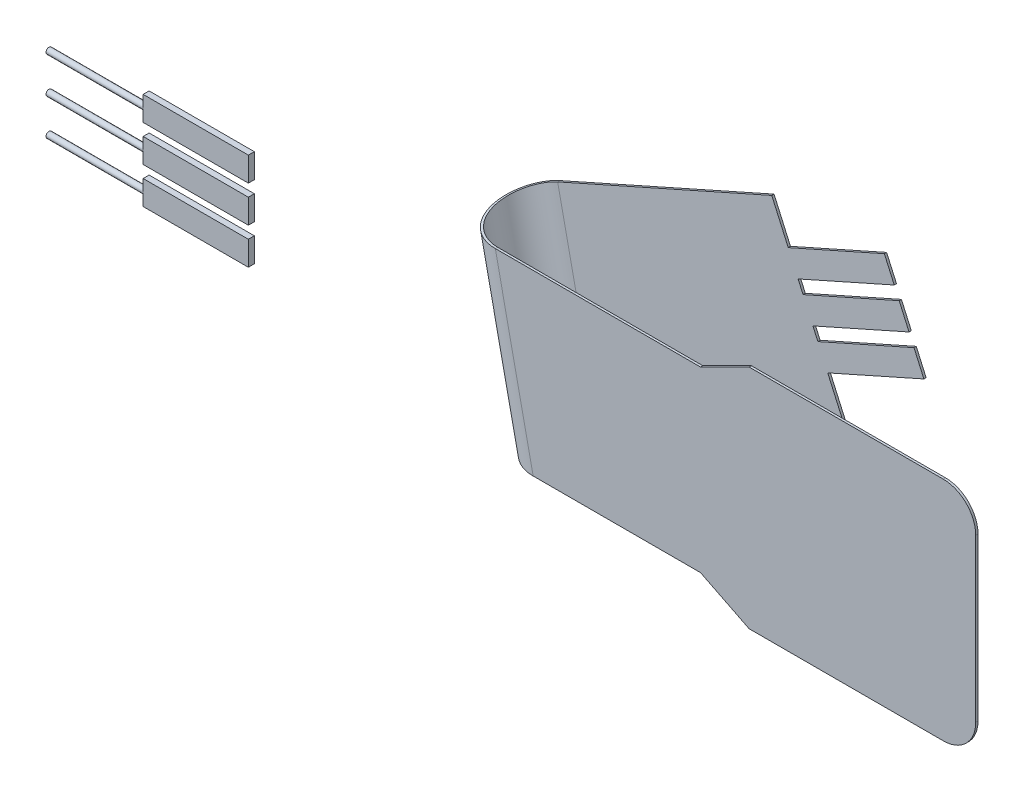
ISO-10303-21;
HEADER;
FILE_DESCRIPTION(('STEP AP214'),'2;1');
FILE_NAME('part.step','',(''),(''),'','','');
FILE_SCHEMA(('AUTOMOTIVE_DESIGN { 1 0 10303 214 1 1 1 1 }'));
ENDSEC;
DATA;
#1=APPLICATION_CONTEXT('core data for automotive mechanical design processes');
#2=APPLICATION_PROTOCOL_DEFINITION('international standard','automotive_design',2000,#1);
#3=PRODUCT_CONTEXT('',#1,'mechanical');
#4=PRODUCT('Part','Part','',(#3));
#5=PRODUCT_RELATED_PRODUCT_CATEGORY('part','',(#4));
#6=PRODUCT_DEFINITION_FORMATION('','',#4);
#7=PRODUCT_DEFINITION_CONTEXT('part definition',#1,'design');
#8=PRODUCT_DEFINITION('design','',#6,#7);
#9=PRODUCT_DEFINITION_SHAPE('','',#8);
#10=(LENGTH_UNIT() NAMED_UNIT(*) SI_UNIT(.MILLI.,.METRE.));
#11=(NAMED_UNIT(*) PLANE_ANGLE_UNIT() SI_UNIT($,.RADIAN.));
#12=(NAMED_UNIT(*) SI_UNIT($,.STERADIAN.) SOLID_ANGLE_UNIT());
#13=UNCERTAINTY_MEASURE_WITH_UNIT(LENGTH_MEASURE(1.E-05),#10,'distance_accuracy_value','');
#14=(GEOMETRIC_REPRESENTATION_CONTEXT(3) GLOBAL_UNCERTAINTY_ASSIGNED_CONTEXT((#13)) GLOBAL_UNIT_ASSIGNED_CONTEXT((#10,
#11,#12)) REPRESENTATION_CONTEXT('',''));
#15=CARTESIAN_POINT('',(0.,0.,0.));
#16=DIRECTION('',(0.,0.,1.));
#17=DIRECTION('',(1.,0.,0.));
#18=AXIS2_PLACEMENT_3D('',#15,#16,#17);
#19=CARTESIAN_POINT('',(-54.1165408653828,-7.56560866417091,-4.00000000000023));
#20=DIRECTION('',(0.,0.,1.));
#21=DIRECTION('',(1.,0.,0.));
#22=AXIS2_PLACEMENT_3D('',#19,#20,#21);
#23=PLANE('',#22);
#24=DIRECTION('',(-0.406736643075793,0.913545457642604,0.));
#25=VECTOR('',#24,1.);
#26=CARTESIAN_POINT('',(-8.72204924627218,10.4560486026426,-3.9999999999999));
#27=LINE('',#26,#25);
#28=CARTESIAN_POINT('',(-9.73889085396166,12.7399122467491,-3.99999999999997));
#29=VERTEX_POINT('',#28);
#30=CARTESIAN_POINT('',(-8.72204924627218,10.4560486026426,-3.9999999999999));
#31=VERTEX_POINT('',#30);
#32=EDGE_CURVE('P0_E408',#29,#31,#27,.F.);
#33=ORIENTED_EDGE('',*,*,#32,.F.);
#34=DIRECTION('',(-0.913545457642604,-0.406736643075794,0.));
#35=VECTOR('',#34,1.);
#36=CARTESIAN_POINT('',(-9.73889085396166,12.7399122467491,-4.));
#37=LINE('',#36,#35);
#38=CARTESIAN_POINT('',(-22.9632013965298,6.8520698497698,-4.0000000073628));
#39=VERTEX_POINT('',#38);
#40=EDGE_CURVE('P0_E398',#39,#29,#37,.F.);
#41=ORIENTED_EDGE('',*,*,#40,.F.);
#42=DIRECTION('',(0.207911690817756,-0.978147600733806,0.));
#43=VECTOR('',#42,1.);
#44=CARTESIAN_POINT('',(-24.4600964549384,13.8944074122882,-4.0000000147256));
#45=LINE('',#44,#43);
#46=CARTESIAN_POINT('',(-20.6250792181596,-4.14793015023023,-4.00000000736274));
#47=VERTEX_POINT('',#46);
#48=EDGE_CURVE('P0_E354',#39,#47,#45,.T.);
#49=ORIENTED_EDGE('',*,*,#48,.T.);
#50=DIRECTION('',(0.913545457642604,0.406736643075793,0.));
#51=VECTOR('',#50,1.);
#52=CARTESIAN_POINT('',(-36.1426242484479,-11.0567863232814,-3.99999999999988));
#53=LINE('',#52,#51);
#54=CARTESIAN_POINT('',(-5.26478778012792,2.69091221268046,-3.99999999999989));
#55=VERTEX_POINT('',#54);
#56=EDGE_CURVE('P0_E383',#55,#47,#53,.F.);
#57=ORIENTED_EDGE('',*,*,#56,.F.);
#58=DIRECTION('',(-0.406736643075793,0.913545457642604,0.));
#59=VECTOR('',#58,1.);
#60=CARTESIAN_POINT('',(-5.26478778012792,2.69091221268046,-3.99999999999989));
#61=LINE('',#60,#59);
#62=CARTESIAN_POINT('',(-6.28162938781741,4.97477585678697,-3.99999999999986));
#63=VERTEX_POINT('',#62);
#64=EDGE_CURVE('P0_E525',#63,#55,#61,.F.);
#65=ORIENTED_EDGE('',*,*,#64,.F.);
#66=DIRECTION('',(0.913545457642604,0.406736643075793,0.));
#67=VECTOR('',#66,1.);
#68=CARTESIAN_POINT('',(-6.28162938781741,4.97477585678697,-3.99999999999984));
#69=LINE('',#68,#67);
#70=CARTESIAN_POINT('',(-0.34358391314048,7.61856403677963,-3.99999999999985));
#71=VERTEX_POINT('',#70);
#72=EDGE_CURVE('P0_E516',#71,#63,#69,.F.);
#73=ORIENTED_EDGE('',*,*,#72,.F.);
#74=DIRECTION('',(-0.406736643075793,0.913545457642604,0.));
#75=VECTOR('',#74,1.);
#76=CARTESIAN_POINT('',(-0.95368887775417,8.98888222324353,-3.99999999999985));
#77=LINE('',#76,#75);
#78=CARTESIAN_POINT('',(-0.95368887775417,8.98888222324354,-3.99999999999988));
#79=VERTEX_POINT('',#78);
#80=EDGE_CURVE('P0_E507',#79,#71,#77,.F.);
#81=ORIENTED_EDGE('',*,*,#80,.F.);
#82=DIRECTION('',(-0.913545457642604,-0.406736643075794,0.));
#83=VECTOR('',#82,1.);
#84=CARTESIAN_POINT('',(-6.89173435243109,6.34509404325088,-3.99999999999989));
#85=LINE('',#84,#83);
#86=CARTESIAN_POINT('',(-6.8917343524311,6.34509404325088,-3.99999999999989));
#87=VERTEX_POINT('',#86);
#88=EDGE_CURVE('P0_E498',#87,#79,#85,.F.);
#89=ORIENTED_EDGE('',*,*,#88,.F.);
#90=DIRECTION('',(-0.406736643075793,0.913545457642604,0.));
#91=VECTOR('',#90,1.);
#92=CARTESIAN_POINT('',(-6.8917343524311,6.34509404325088,-3.99999999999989));
#93=LINE('',#92,#91);
#94=CARTESIAN_POINT('',(-7.19678683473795,7.03025313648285,-3.99999999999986));
#95=VERTEX_POINT('',#94);
#96=EDGE_CURVE('P0_E488',#95,#87,#93,.F.);
#97=ORIENTED_EDGE('',*,*,#96,.F.);
#98=DIRECTION('',(0.913545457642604,0.406736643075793,0.));
#99=VECTOR('',#98,1.);
#100=CARTESIAN_POINT('',(-7.19678683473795,7.03025313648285,-3.99999999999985));
#101=LINE('',#100,#99);
#102=CARTESIAN_POINT('',(-1.25874136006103,9.6740413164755,-3.99999999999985));
#103=VERTEX_POINT('',#102);
#104=EDGE_CURVE('P0_E478',#103,#95,#101,.F.);
#105=ORIENTED_EDGE('',*,*,#104,.F.);
#106=DIRECTION('',(-0.406736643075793,0.913545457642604,0.));
#107=VECTOR('',#106,1.);
#108=CARTESIAN_POINT('',(-1.86884632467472,11.0443595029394,-3.99999999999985));
#109=LINE('',#108,#107);
#110=CARTESIAN_POINT('',(-1.86884632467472,11.0443595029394,-3.99999999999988));
#111=VERTEX_POINT('',#110);
#112=EDGE_CURVE('P0_E468',#111,#103,#109,.F.);
#113=ORIENTED_EDGE('',*,*,#112,.F.);
#114=DIRECTION('',(-0.913545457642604,-0.406736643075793,0.));
#115=VECTOR('',#114,1.);
#116=CARTESIAN_POINT('',(-7.80689179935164,8.40057132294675,-3.99999999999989));
#117=LINE('',#116,#115);
#118=CARTESIAN_POINT('',(-7.80689179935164,8.40057132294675,-3.9999999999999));
#119=VERTEX_POINT('',#118);
#120=EDGE_CURVE('P0_E458',#119,#111,#117,.F.);
#121=ORIENTED_EDGE('',*,*,#120,.F.);
#122=DIRECTION('',(-0.406736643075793,0.913545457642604,0.));
#123=VECTOR('',#122,1.);
#124=CARTESIAN_POINT('',(-7.80689179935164,8.40057132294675,-3.9999999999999));
#125=LINE('',#124,#123);
#126=CARTESIAN_POINT('',(-8.11194428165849,9.08573041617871,-3.99999999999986));
#127=VERTEX_POINT('',#126);
#128=EDGE_CURVE('P0_E448',#127,#119,#125,.F.);
#129=ORIENTED_EDGE('',*,*,#128,.F.);
#130=DIRECTION('',(0.913545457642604,0.406736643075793,0.));
#131=VECTOR('',#130,1.);
#132=CARTESIAN_POINT('',(-8.11194428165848,9.08573041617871,-3.99999999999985));
#133=LINE('',#132,#131);
#134=CARTESIAN_POINT('',(-2.17389880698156,11.7295185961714,-3.99999999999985));
#135=VERTEX_POINT('',#134);
#136=EDGE_CURVE('P0_E438',#135,#127,#133,.F.);
#137=ORIENTED_EDGE('',*,*,#136,.F.);
#138=DIRECTION('',(-0.406736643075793,0.913545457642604,0.));
#139=VECTOR('',#138,1.);
#140=CARTESIAN_POINT('',(-2.78400377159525,13.0998367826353,-3.99999999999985));
#141=LINE('',#140,#139);
#142=CARTESIAN_POINT('',(-2.78400377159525,13.0998367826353,-3.99999999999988));
#143=VERTEX_POINT('',#142);
#144=EDGE_CURVE('P0_E428',#143,#135,#141,.F.);
#145=ORIENTED_EDGE('',*,*,#144,.F.);
#146=DIRECTION('',(-0.913545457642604,-0.406736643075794,0.));
#147=VECTOR('',#146,1.);
#148=CARTESIAN_POINT('',(-8.72204924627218,10.4560486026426,-3.9999999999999));
#149=LINE('',#148,#147);
#150=EDGE_CURVE('P0_E418',#31,#143,#149,.F.);
#151=ORIENTED_EDGE('',*,*,#150,.F.);
#152=EDGE_LOOP('',(#33,#41,#49,#57,#65,#73,#81,#89,#97,#105,#113,#121,#129,#137,#145,#151));
#153=FACE_BOUND('',#152,.T.);
#154=ADVANCED_FACE('P0_F16',(#153),#23,.T.);
#155=CARTESIAN_POINT('',(-5.26478778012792,2.69091221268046,-4.13999999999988));
#156=DIRECTION('',(0.913545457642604,0.406736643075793,0.));
#157=DIRECTION('',(-0.406736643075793,0.913545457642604,0.));
#158=AXIS2_PLACEMENT_3D('',#155,#156,#157);
#159=PLANE('',#158);
#160=DIRECTION('',(-0.406736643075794,0.913545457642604,0.));
#161=VECTOR('',#160,1.);
#162=CARTESIAN_POINT('',(-5.26478778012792,2.69091221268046,-4.13999999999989));
#163=LINE('',#162,#161);
#164=CARTESIAN_POINT('',(-5.26478778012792,2.69091221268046,-4.13999999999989));
#165=VERTEX_POINT('',#164);
#166=CARTESIAN_POINT('',(-6.28162938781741,4.97477585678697,-4.13999999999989));
#167=VERTEX_POINT('',#166);
#168=EDGE_CURVE('P0_E352',#165,#167,#163,.T.);
#169=ORIENTED_EDGE('',*,*,#168,.T.);
#170=DIRECTION('',(0.,0.,1.));
#171=VECTOR('',#170,1.);
#172=CARTESIAN_POINT('',(-6.28162938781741,4.97477585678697,-4.13999999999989));
#173=LINE('',#172,#171);
#174=EDGE_CURVE('P0_E514',#63,#167,#173,.F.);
#175=ORIENTED_EDGE('',*,*,#174,.F.);
#176=ORIENTED_EDGE('',*,*,#64,.T.);
#177=DIRECTION('',(0.,0.,1.));
#178=VECTOR('',#177,1.);
#179=CARTESIAN_POINT('',(-5.26478778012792,2.69091221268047,-4.14000000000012));
#180=LINE('',#179,#178);
#181=EDGE_CURVE('P0_E387',#165,#55,#180,.T.);
#182=ORIENTED_EDGE('',*,*,#181,.F.);
#183=EDGE_LOOP('',(#169,#175,#176,#182));
#184=FACE_BOUND('',#183,.T.);
#185=ADVANCED_FACE('P0_F576',(#184),#159,.T.);
#186=CARTESIAN_POINT('',(-6.28162938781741,4.97477585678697,-4.13999999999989));
#187=DIRECTION('',(0.406736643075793,-0.913545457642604,0.));
#188=DIRECTION('',(0.913545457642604,0.406736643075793,0.));
#189=AXIS2_PLACEMENT_3D('',#186,#187,#188);
#190=PLANE('',#189);
#191=DIRECTION('',(0.913545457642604,0.406736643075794,0.));
#192=VECTOR('',#191,1.);
#193=CARTESIAN_POINT('',(-6.28162938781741,4.97477585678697,-4.13999999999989));
#194=LINE('',#193,#192);
#195=CARTESIAN_POINT('',(-0.34358391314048,7.61856403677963,-4.13999999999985));
#196=VERTEX_POINT('',#195);
#197=EDGE_CURVE('P0_E394',#167,#196,#194,.T.);
#198=ORIENTED_EDGE('',*,*,#197,.T.);
#199=DIRECTION('',(0.,0.,1.));
#200=VECTOR('',#199,1.);
#201=CARTESIAN_POINT('',(-0.34358391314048,7.61856403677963,-4.13999999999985));
#202=LINE('',#201,#200);
#203=EDGE_CURVE('P0_E505',#71,#196,#202,.F.);
#204=ORIENTED_EDGE('',*,*,#203,.F.);
#205=ORIENTED_EDGE('',*,*,#72,.T.);
#206=ORIENTED_EDGE('',*,*,#174,.T.);
#207=EDGE_LOOP('',(#198,#204,#205,#206));
#208=FACE_BOUND('',#207,.T.);
#209=ADVANCED_FACE('P0_F567',(#208),#190,.T.);
#210=CARTESIAN_POINT('',(-0.953688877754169,8.98888222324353,-4.13999999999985));
#211=DIRECTION('',(0.913545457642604,0.406736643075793,0.));
#212=DIRECTION('',(-0.406736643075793,0.913545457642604,0.));
#213=AXIS2_PLACEMENT_3D('',#210,#211,#212);
#214=PLANE('',#213);
#215=DIRECTION('',(-0.406736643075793,0.913545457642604,0.));
#216=VECTOR('',#215,1.);
#217=CARTESIAN_POINT('',(-0.343583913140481,7.61856403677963,-4.13999999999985));
#218=LINE('',#217,#216);
#219=CARTESIAN_POINT('',(-0.953688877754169,8.98888222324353,-4.13999999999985));
#220=VERTEX_POINT('',#219);
#221=EDGE_CURVE('P0_E493',#196,#220,#218,.T.);
#222=ORIENTED_EDGE('',*,*,#221,.T.);
#223=DIRECTION('',(0.,0.,1.));
#224=VECTOR('',#223,1.);
#225=CARTESIAN_POINT('',(-0.953688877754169,8.98888222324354,-4.13999999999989));
#226=LINE('',#225,#224);
#227=EDGE_CURVE('P0_E496',#79,#220,#226,.F.);
#228=ORIENTED_EDGE('',*,*,#227,.F.);
#229=ORIENTED_EDGE('',*,*,#80,.T.);
#230=ORIENTED_EDGE('',*,*,#203,.T.);
#231=EDGE_LOOP('',(#222,#228,#229,#230));
#232=FACE_BOUND('',#231,.T.);
#233=ADVANCED_FACE('P0_F813',(#232),#214,.T.);
#234=CARTESIAN_POINT('',(-6.89173435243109,6.34509404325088,-4.13999999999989));
#235=DIRECTION('',(-0.406736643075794,0.913545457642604,0.));
#236=DIRECTION('',(-0.913545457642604,-0.406736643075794,0.));
#237=AXIS2_PLACEMENT_3D('',#234,#235,#236);
#238=PLANE('',#237);
#239=DIRECTION('',(-0.913545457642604,-0.406736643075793,0.));
#240=VECTOR('',#239,1.);
#241=CARTESIAN_POINT('',(-0.953688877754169,8.98888222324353,-4.13999999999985));
#242=LINE('',#241,#240);
#243=CARTESIAN_POINT('',(-6.89173435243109,6.34509404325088,-4.13999999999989));
#244=VERTEX_POINT('',#243);
#245=EDGE_CURVE('P0_E483',#220,#244,#242,.T.);
#246=ORIENTED_EDGE('',*,*,#245,.T.);
#247=DIRECTION('',(0.,0.,1.));
#248=VECTOR('',#247,1.);
#249=CARTESIAN_POINT('',(-6.89173435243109,6.34509404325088,-4.13999999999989));
#250=LINE('',#249,#248);
#251=EDGE_CURVE('P0_E486',#87,#244,#250,.F.);
#252=ORIENTED_EDGE('',*,*,#251,.F.);
#253=ORIENTED_EDGE('',*,*,#88,.T.);
#254=ORIENTED_EDGE('',*,*,#227,.T.);
#255=EDGE_LOOP('',(#246,#252,#253,#254));
#256=FACE_BOUND('',#255,.T.);
#257=ADVANCED_FACE('P0_F803',(#256),#238,.T.);
#258=CARTESIAN_POINT('',(-6.89173435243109,6.34509404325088,-4.13999999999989));
#259=DIRECTION('',(0.913545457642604,0.406736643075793,0.));
#260=DIRECTION('',(-0.406736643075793,0.913545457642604,0.));
#261=AXIS2_PLACEMENT_3D('',#258,#259,#260);
#262=PLANE('',#261);
#263=DIRECTION('',(-0.406736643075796,0.913545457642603,0.));
#264=VECTOR('',#263,1.);
#265=CARTESIAN_POINT('',(-6.89173435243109,6.34509404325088,-4.13999999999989));
#266=LINE('',#265,#264);
#267=CARTESIAN_POINT('',(-7.19678683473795,7.03025313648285,-4.13999999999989));
#268=VERTEX_POINT('',#267);
#269=EDGE_CURVE('P0_E473',#244,#268,#266,.T.);
#270=ORIENTED_EDGE('',*,*,#269,.T.);
#271=DIRECTION('',(0.,0.,1.));
#272=VECTOR('',#271,1.);
#273=CARTESIAN_POINT('',(-7.19678683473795,7.03025313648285,-4.13999999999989));
#274=LINE('',#273,#272);
#275=EDGE_CURVE('P0_E476',#95,#268,#274,.F.);
#276=ORIENTED_EDGE('',*,*,#275,.F.);
#277=ORIENTED_EDGE('',*,*,#96,.T.);
#278=ORIENTED_EDGE('',*,*,#251,.T.);
#279=EDGE_LOOP('',(#270,#276,#277,#278));
#280=FACE_BOUND('',#279,.T.);
#281=ADVANCED_FACE('P0_F793',(#280),#262,.T.);
#282=CARTESIAN_POINT('',(-7.19678683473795,7.03025313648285,-4.13999999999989));
#283=DIRECTION('',(0.406736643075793,-0.913545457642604,0.));
#284=DIRECTION('',(0.913545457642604,0.406736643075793,0.));
#285=AXIS2_PLACEMENT_3D('',#282,#283,#284);
#286=PLANE('',#285);
#287=DIRECTION('',(0.913545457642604,0.406736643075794,0.));
#288=VECTOR('',#287,1.);
#289=CARTESIAN_POINT('',(-7.19678683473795,7.03025313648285,-4.13999999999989));
#290=LINE('',#289,#288);
#291=CARTESIAN_POINT('',(-1.25874136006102,9.67404131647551,-4.13999999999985));
#292=VERTEX_POINT('',#291);
#293=EDGE_CURVE('P0_E463',#268,#292,#290,.T.);
#294=ORIENTED_EDGE('',*,*,#293,.T.);
#295=DIRECTION('',(0.,0.,1.));
#296=VECTOR('',#295,1.);
#297=CARTESIAN_POINT('',(-1.25874136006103,9.6740413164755,-4.13999999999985));
#298=LINE('',#297,#296);
#299=EDGE_CURVE('P0_E466',#103,#292,#298,.F.);
#300=ORIENTED_EDGE('',*,*,#299,.F.);
#301=ORIENTED_EDGE('',*,*,#104,.T.);
#302=ORIENTED_EDGE('',*,*,#275,.T.);
#303=EDGE_LOOP('',(#294,#300,#301,#302));
#304=FACE_BOUND('',#303,.T.);
#305=ADVANCED_FACE('P0_F783',(#304),#286,.T.);
#306=CARTESIAN_POINT('',(-1.86884632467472,11.0443595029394,-4.13999999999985));
#307=DIRECTION('',(0.913545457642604,0.406736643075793,0.));
#308=DIRECTION('',(-0.406736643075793,0.913545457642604,0.));
#309=AXIS2_PLACEMENT_3D('',#306,#307,#308);
#310=PLANE('',#309);
#311=DIRECTION('',(-0.406736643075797,0.913545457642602,0.));
#312=VECTOR('',#311,1.);
#313=CARTESIAN_POINT('',(-1.25874136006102,9.67404131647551,-4.13999999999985));
#314=LINE('',#313,#312);
#315=CARTESIAN_POINT('',(-1.86884632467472,11.0443595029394,-4.13999999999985));
#316=VERTEX_POINT('',#315);
#317=EDGE_CURVE('P0_E453',#292,#316,#314,.T.);
#318=ORIENTED_EDGE('',*,*,#317,.T.);
#319=DIRECTION('',(0.,0.,1.));
#320=VECTOR('',#319,1.);
#321=CARTESIAN_POINT('',(-1.86884632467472,11.0443595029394,-4.13999999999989));
#322=LINE('',#321,#320);
#323=EDGE_CURVE('P0_E456',#111,#316,#322,.F.);
#324=ORIENTED_EDGE('',*,*,#323,.F.);
#325=ORIENTED_EDGE('',*,*,#112,.T.);
#326=ORIENTED_EDGE('',*,*,#299,.T.);
#327=EDGE_LOOP('',(#318,#324,#325,#326));
#328=FACE_BOUND('',#327,.T.);
#329=ADVANCED_FACE('P0_F773',(#328),#310,.T.);
#330=CARTESIAN_POINT('',(-7.80689179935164,8.40057132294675,-4.13999999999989));
#331=DIRECTION('',(-0.406736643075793,0.913545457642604,0.));
#332=DIRECTION('',(-0.913545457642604,-0.406736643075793,0.));
#333=AXIS2_PLACEMENT_3D('',#330,#331,#332);
#334=PLANE('',#333);
#335=DIRECTION('',(-0.913545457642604,-0.406736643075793,0.));
#336=VECTOR('',#335,1.);
#337=CARTESIAN_POINT('',(-1.86884632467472,11.0443595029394,-4.13999999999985));
#338=LINE('',#337,#336);
#339=CARTESIAN_POINT('',(-7.80689179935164,8.40057132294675,-4.13999999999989));
#340=VERTEX_POINT('',#339);
#341=EDGE_CURVE('P0_E443',#316,#340,#338,.T.);
#342=ORIENTED_EDGE('',*,*,#341,.T.);
#343=DIRECTION('',(0.,0.,1.));
#344=VECTOR('',#343,1.);
#345=CARTESIAN_POINT('',(-7.80689179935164,8.40057132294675,-4.13999999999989));
#346=LINE('',#345,#344);
#347=EDGE_CURVE('P0_E446',#119,#340,#346,.F.);
#348=ORIENTED_EDGE('',*,*,#347,.F.);
#349=ORIENTED_EDGE('',*,*,#120,.T.);
#350=ORIENTED_EDGE('',*,*,#323,.T.);
#351=EDGE_LOOP('',(#342,#348,#349,#350));
#352=FACE_BOUND('',#351,.T.);
#353=ADVANCED_FACE('P0_F763',(#352),#334,.T.);
#354=CARTESIAN_POINT('',(-7.80689179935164,8.40057132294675,-4.13999999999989));
#355=DIRECTION('',(0.913545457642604,0.406736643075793,0.));
#356=DIRECTION('',(-0.406736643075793,0.913545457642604,0.));
#357=AXIS2_PLACEMENT_3D('',#354,#355,#356);
#358=PLANE('',#357);
#359=DIRECTION('',(-0.406736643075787,0.913545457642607,0.));
#360=VECTOR('',#359,1.);
#361=CARTESIAN_POINT('',(-7.80689179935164,8.40057132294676,-4.13999999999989));
#362=LINE('',#361,#360);
#363=CARTESIAN_POINT('',(-8.11194428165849,9.08573041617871,-4.1399999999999));
#364=VERTEX_POINT('',#363);
#365=EDGE_CURVE('P0_E433',#340,#364,#362,.T.);
#366=ORIENTED_EDGE('',*,*,#365,.T.);
#367=DIRECTION('',(0.,0.,1.));
#368=VECTOR('',#367,1.);
#369=CARTESIAN_POINT('',(-8.11194428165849,9.08573041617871,-4.13999999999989));
#370=LINE('',#369,#368);
#371=EDGE_CURVE('P0_E436',#127,#364,#370,.F.);
#372=ORIENTED_EDGE('',*,*,#371,.F.);
#373=ORIENTED_EDGE('',*,*,#128,.T.);
#374=ORIENTED_EDGE('',*,*,#347,.T.);
#375=EDGE_LOOP('',(#366,#372,#373,#374));
#376=FACE_BOUND('',#375,.T.);
#377=ADVANCED_FACE('P0_F753',(#376),#358,.T.);
#378=CARTESIAN_POINT('',(-8.11194428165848,9.08573041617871,-4.13999999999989));
#379=DIRECTION('',(0.406736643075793,-0.913545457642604,0.));
#380=DIRECTION('',(0.913545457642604,0.406736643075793,0.));
#381=AXIS2_PLACEMENT_3D('',#378,#379,#380);
#382=PLANE('',#381);
#383=DIRECTION('',(0.913545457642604,0.406736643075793,0.));
#384=VECTOR('',#383,1.);
#385=CARTESIAN_POINT('',(-8.11194428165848,9.08573041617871,-4.1399999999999));
#386=LINE('',#385,#384);
#387=CARTESIAN_POINT('',(-2.17389880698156,11.7295185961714,-4.13999999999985));
#388=VERTEX_POINT('',#387);
#389=EDGE_CURVE('P0_E423',#364,#388,#386,.T.);
#390=ORIENTED_EDGE('',*,*,#389,.T.);
#391=DIRECTION('',(0.,0.,1.));
#392=VECTOR('',#391,1.);
#393=CARTESIAN_POINT('',(-2.17389880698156,11.7295185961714,-4.13999999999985));
#394=LINE('',#393,#392);
#395=EDGE_CURVE('P0_E426',#135,#388,#394,.F.);
#396=ORIENTED_EDGE('',*,*,#395,.F.);
#397=ORIENTED_EDGE('',*,*,#136,.T.);
#398=ORIENTED_EDGE('',*,*,#371,.T.);
#399=EDGE_LOOP('',(#390,#396,#397,#398));
#400=FACE_BOUND('',#399,.T.);
#401=ADVANCED_FACE('P0_F743',(#400),#382,.T.);
#402=CARTESIAN_POINT('',(-2.78400377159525,13.0998367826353,-4.13999999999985));
#403=DIRECTION('',(0.913545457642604,0.406736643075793,0.));
#404=DIRECTION('',(-0.406736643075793,0.913545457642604,0.));
#405=AXIS2_PLACEMENT_3D('',#402,#403,#404);
#406=PLANE('',#405);
#407=DIRECTION('',(-0.406736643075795,0.913545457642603,0.));
#408=VECTOR('',#407,1.);
#409=CARTESIAN_POINT('',(-2.17389880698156,11.7295185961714,-4.13999999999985));
#410=LINE('',#409,#408);
#411=CARTESIAN_POINT('',(-2.78400377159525,13.0998367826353,-4.13999999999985));
#412=VERTEX_POINT('',#411);
#413=EDGE_CURVE('P0_E413',#388,#412,#410,.T.);
#414=ORIENTED_EDGE('',*,*,#413,.T.);
#415=DIRECTION('',(0.,0.,1.));
#416=VECTOR('',#415,1.);
#417=CARTESIAN_POINT('',(-2.78400377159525,13.0998367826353,-4.1399999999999));
#418=LINE('',#417,#416);
#419=EDGE_CURVE('P0_E416',#143,#412,#418,.F.);
#420=ORIENTED_EDGE('',*,*,#419,.F.);
#421=ORIENTED_EDGE('',*,*,#144,.T.);
#422=ORIENTED_EDGE('',*,*,#395,.T.);
#423=EDGE_LOOP('',(#414,#420,#421,#422));
#424=FACE_BOUND('',#423,.T.);
#425=ADVANCED_FACE('P0_F733',(#424),#406,.T.);
#426=CARTESIAN_POINT('',(-8.72204924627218,10.4560486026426,-4.1399999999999));
#427=DIRECTION('',(-0.406736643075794,0.913545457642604,0.));
#428=DIRECTION('',(-0.913545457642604,-0.406736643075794,0.));
#429=AXIS2_PLACEMENT_3D('',#426,#427,#428);
#430=PLANE('',#429);
#431=DIRECTION('',(-0.913545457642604,-0.406736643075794,0.));
#432=VECTOR('',#431,1.);
#433=CARTESIAN_POINT('',(-2.78400377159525,13.0998367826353,-4.13999999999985));
#434=LINE('',#433,#432);
#435=CARTESIAN_POINT('',(-8.72204924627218,10.4560486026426,-4.1399999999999));
#436=VERTEX_POINT('',#435);
#437=EDGE_CURVE('P0_E403',#412,#436,#434,.T.);
#438=ORIENTED_EDGE('',*,*,#437,.T.);
#439=DIRECTION('',(0.,0.,1.));
#440=VECTOR('',#439,1.);
#441=CARTESIAN_POINT('',(-8.72204924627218,10.4560486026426,-4.1399999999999));
#442=LINE('',#441,#440);
#443=EDGE_CURVE('P0_E406',#31,#436,#442,.F.);
#444=ORIENTED_EDGE('',*,*,#443,.F.);
#445=ORIENTED_EDGE('',*,*,#150,.T.);
#446=ORIENTED_EDGE('',*,*,#419,.T.);
#447=EDGE_LOOP('',(#438,#444,#445,#446));
#448=FACE_BOUND('',#447,.T.);
#449=ADVANCED_FACE('P0_F723',(#448),#430,.T.);
#450=CARTESIAN_POINT('',(-8.72204924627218,10.4560486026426,-4.1399999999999));
#451=DIRECTION('',(0.913545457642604,0.406736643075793,0.));
#452=DIRECTION('',(-0.406736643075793,0.913545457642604,0.));
#453=AXIS2_PLACEMENT_3D('',#450,#451,#452);
#454=PLANE('',#453);
#455=DIRECTION('',(-0.406736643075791,0.913545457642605,0.));
#456=VECTOR('',#455,1.);
#457=CARTESIAN_POINT('',(-8.72204924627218,10.4560486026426,-4.1399999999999));
#458=LINE('',#457,#456);
#459=CARTESIAN_POINT('',(-9.73889085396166,12.7399122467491,-4.1399999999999));
#460=VERTEX_POINT('',#459);
#461=EDGE_CURVE('P0_E347',#436,#460,#458,.T.);
#462=ORIENTED_EDGE('',*,*,#461,.T.);
#463=DIRECTION('',(0.,0.,1.));
#464=VECTOR('',#463,1.);
#465=CARTESIAN_POINT('',(-9.73889085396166,12.7399122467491,-4.1399999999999));
#466=LINE('',#465,#464);
#467=EDGE_CURVE('P0_E98',#29,#460,#466,.F.);
#468=ORIENTED_EDGE('',*,*,#467,.F.);
#469=ORIENTED_EDGE('',*,*,#32,.T.);
#470=ORIENTED_EDGE('',*,*,#443,.T.);
#471=EDGE_LOOP('',(#462,#468,#469,#470));
#472=FACE_BOUND('',#471,.T.);
#473=ADVANCED_FACE('P0_F633',(#472),#454,.T.);
#474=CARTESIAN_POINT('',(-9.73889085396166,12.7399122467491,-4.1399999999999));
#475=DIRECTION('',(-0.406736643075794,0.913545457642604,0.));
#476=DIRECTION('',(-0.913545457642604,-0.406736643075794,0.));
#477=AXIS2_PLACEMENT_3D('',#474,#475,#476);
#478=PLANE('',#477);
#479=ORIENTED_EDGE('',*,*,#467,.T.);
#480=DIRECTION('',(-0.913545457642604,-0.406736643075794,0.));
#481=VECTOR('',#480,1.);
#482=CARTESIAN_POINT('',(-9.73889085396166,12.7399122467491,-4.1399999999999));
#483=LINE('',#482,#481);
#484=CARTESIAN_POINT('',(-22.9632013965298,6.8520698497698,-4.1400000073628));
#485=VERTEX_POINT('',#484);
#486=EDGE_CURVE('P0_E343',#460,#485,#483,.T.);
#487=ORIENTED_EDGE('',*,*,#486,.T.);
#488=DIRECTION('',(0.,0.,-1.));
#489=VECTOR('',#488,1.);
#490=CARTESIAN_POINT('',(-22.9632013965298,6.8520698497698,-4.0700000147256));
#491=LINE('',#490,#489);
#492=EDGE_CURVE('P0_E350',#39,#485,#491,.T.);
#493=ORIENTED_EDGE('',*,*,#492,.F.);
#494=ORIENTED_EDGE('',*,*,#40,.T.);
#495=EDGE_LOOP('',(#479,#487,#493,#494));
#496=FACE_BOUND('',#495,.T.);
#497=ADVANCED_FACE('P0_F593',(#496),#478,.T.);
#498=CARTESIAN_POINT('',(-36.1426242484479,-11.0567863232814,-4.14000000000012));
#499=DIRECTION('',(0.406736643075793,-0.913545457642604,0.));
#500=DIRECTION('',(0.913545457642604,0.406736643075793,0.));
#501=AXIS2_PLACEMENT_3D('',#498,#499,#500);
#502=PLANE('',#501);
#503=ORIENTED_EDGE('',*,*,#181,.T.);
#504=ORIENTED_EDGE('',*,*,#56,.T.);
#505=DIRECTION('',(0.,0.,1.));
#506=VECTOR('',#505,1.);
#507=CARTESIAN_POINT('',(-20.6250792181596,-4.14793015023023,-4.14000000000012));
#508=LINE('',#507,#506);
#509=CARTESIAN_POINT('',(-20.6250792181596,-4.14793015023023,-4.1400000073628));
#510=VERTEX_POINT('',#509);
#511=EDGE_CURVE('P0_E384',#47,#510,#508,.F.);
#512=ORIENTED_EDGE('',*,*,#511,.T.);
#513=DIRECTION('',(0.913545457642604,0.406736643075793,0.));
#514=VECTOR('',#513,1.);
#515=CARTESIAN_POINT('',(-20.6250792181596,-4.14793015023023,-4.14));
#516=LINE('',#515,#514);
#517=EDGE_CURVE('P0_E296',#510,#165,#516,.T.);
#518=ORIENTED_EDGE('',*,*,#517,.T.);
#519=EDGE_LOOP('',(#503,#504,#512,#518));
#520=FACE_BOUND('',#519,.T.);
#521=ADVANCED_FACE('P0_F286',(#520),#502,.T.);
#522=CARTESIAN_POINT('',(-24.4600964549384,13.8944074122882,-2.));
#523=DIRECTION('',(0.207911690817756,-0.978147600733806,0.));
#524=DIRECTION('',(0.978147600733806,0.207911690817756,0.));
#525=AXIS2_PLACEMENT_3D('',#522,#523,#524);
#526=CYLINDRICAL_SURFACE('',#525,2.0000000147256);
#527=DIRECTION('',(-0.207911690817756,0.978147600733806,0.));
#528=VECTOR('',#527,1.);
#529=CARTESIAN_POINT('',(-20.3376878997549,-5.50000000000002,0.));
#530=LINE('',#529,#528);
#531=CARTESIAN_POINT('',(-20.3376878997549,-5.50000000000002,7.36279751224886E-09));
#532=VERTEX_POINT('',#531);
#533=CARTESIAN_POINT('',(-22.6758100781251,5.50000000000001,7.36279751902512E-09));
#534=VERTEX_POINT('',#533);
#535=EDGE_CURVE('P0_E87',#532,#534,#530,.T.);
#536=ORIENTED_EDGE('',*,*,#535,.F.);
#537=CARTESIAN_POINT('',(-20.6250792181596,-4.14793015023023,-4.00000001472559));
#538=CARTESIAN_POINT('',(-20.6684641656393,-4.16761731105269,-4.00000228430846));
#539=CARTESIAN_POINT('',(-20.7118456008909,-4.18730302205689,-3.99837622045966));
#540=CARTESIAN_POINT('',(-20.7984653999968,-4.22666268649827,-3.9918802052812));
#541=CARTESIAN_POINT('',(-20.8417033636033,-4.24633655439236,-3.98700439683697));
#542=CARTESIAN_POINT('',(-20.9378197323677,-4.29019031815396,-3.97250109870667));
#543=CARTESIAN_POINT('',(-20.9905836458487,-4.31434611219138,-3.96202803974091));
#544=CARTESIAN_POINT('',(-21.0950299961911,-4.3624304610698,-3.93623765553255));
#545=CARTESIAN_POINT('',(-21.1467121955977,-4.38635896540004,-3.92091927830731));
#546=CARTESIAN_POINT('',(-21.2486210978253,-4.43391712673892,-3.88553725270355));
#547=CARTESIAN_POINT('',(-21.2988467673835,-4.45754656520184,-3.86547032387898));
#548=CARTESIAN_POINT('',(-21.3974378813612,-4.50441775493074,-3.8207394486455));
#549=CARTESIAN_POINT('',(-21.4458017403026,-4.5276591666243,-3.79607168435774));
#550=CARTESIAN_POINT('',(-21.5873645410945,-4.59660125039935,-3.71550232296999));
#551=CARTESIAN_POINT('',(-21.6772287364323,-4.6416095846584,-3.65296708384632));
#552=CARTESIAN_POINT('',(-21.8450095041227,-4.72909066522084,-3.51208703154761));
#553=CARTESIAN_POINT('',(-21.9229256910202,-4.77156332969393,-3.43374170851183));
#554=CARTESIAN_POINT('',(-22.0289636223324,-4.83294986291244,-3.30621509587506));
#555=CARTESIAN_POINT('',(-22.0625223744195,-4.85303763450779,-3.26200515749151));
#556=CARTESIAN_POINT('',(-22.1257525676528,-4.89237629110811,-3.17059198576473));
#557=CARTESIAN_POINT('',(-22.155427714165,-4.91162796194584,-3.12339167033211));
#558=CARTESIAN_POINT('',(-22.2106854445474,-4.94926710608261,-3.02629824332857));
#559=CARTESIAN_POINT('',(-22.2362664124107,-4.96765423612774,-2.97640407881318));
#560=CARTESIAN_POINT('',(-22.2831174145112,-5.00351266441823,-2.87431722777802));
#561=CARTESIAN_POINT('',(-22.3043864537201,-5.02098375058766,-2.82212401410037));
#562=CARTESIAN_POINT('',(-22.3614251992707,-5.07195130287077,-2.66269378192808));
#563=CARTESIAN_POINT('',(-22.3904837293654,-5.10404063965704,-2.55250557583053));
#564=CARTESIAN_POINT('',(-22.4295454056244,-5.16415376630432,-2.32779473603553));
#565=CARTESIAN_POINT('',(-22.4395484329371,-5.19217753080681,-2.21327207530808));
#566=CARTESIAN_POINT('',(-22.4400769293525,-5.24409155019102,-1.98323216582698));
#567=CARTESIAN_POINT('',(-22.4306023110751,-5.26798178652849,-1.86771491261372));
#568=CARTESIAN_POINT('',(-22.3922930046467,-5.3116420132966,-1.63914415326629));
#569=CARTESIAN_POINT('',(-22.3634586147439,-5.33141206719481,-1.52609060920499));
#570=CARTESIAN_POINT('',(-22.2871329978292,-5.36699081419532,-1.30580765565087));
#571=CARTESIAN_POINT('',(-22.2396418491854,-5.38279952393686,-1.19857822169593));
#572=CARTESIAN_POINT('',(-22.1272583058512,-5.41071496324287,-0.993132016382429));
#573=CARTESIAN_POINT('',(-22.0623654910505,-5.42282160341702,-0.89491546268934));
#574=CARTESIAN_POINT('',(-21.9169558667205,-5.44371619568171,-0.710424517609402));
#575=CARTESIAN_POINT('',(-21.8364393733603,-5.452504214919,-0.62414988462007));
#576=CARTESIAN_POINT('',(-21.6620171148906,-5.46723361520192,-0.466106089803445));
#577=CARTESIAN_POINT('',(-21.5681111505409,-5.47317495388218,-0.394337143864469));
#578=CARTESIAN_POINT('',(-21.369541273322,-5.48277444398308,-0.267431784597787));
#579=CARTESIAN_POINT('',(-21.2648751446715,-5.48643212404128,-0.212298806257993));
#580=CARTESIAN_POINT('',(-21.0477603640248,-5.49209148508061,-0.120339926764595));
#581=CARTESIAN_POINT('',(-20.9353150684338,-5.49409387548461,-0.083506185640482));
#582=CARTESIAN_POINT('',(-20.7415318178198,-5.49664866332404,-0.0376482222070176));
#583=CARTESIAN_POINT('',(-20.6613615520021,-5.49745815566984,-0.0235421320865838));
#584=CARTESIAN_POINT('',(-20.5000343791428,-5.49884439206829,-0.00471694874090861));
#585=CARTESIAN_POINT('',(-20.4188789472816,-5.49942144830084,1.47687174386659E-05));
#586=CARTESIAN_POINT('',(-20.3376878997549,-5.50000000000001,1.47255939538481E-08));
#587=B_SPLINE_CURVE_WITH_KNOTS('',3,(#537,#538,#539,#540,#541,#542,#543,#544,#545,#546,#547,
#548,#549,#550,#551,#552,#553,#554,#555,#556,#557,#558,#559,#560,#561,#562,#563,#564,#565,#566,
#567,#568,#569,#570,#571,#572,#573,#574,#575,#576,#577,#578,#579,#580,#581,#582,#583,#584,#585,
#586),.UNSPECIFIED.,.F.,.F.,(4,2,2,2,2,2,2,2,2,2,2,2,2,2,2,2,2,2,2,2,2,2,2,2,4),(0.,
0.142893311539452,0.286044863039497,0.462731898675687,0.639457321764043,0.81630519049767,
0.993300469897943,1.34662691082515,1.69996474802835,1.87687073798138,2.05360669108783,
2.23041223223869,2.40725852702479,2.76058979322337,3.11392326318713,3.4672583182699,
3.82058793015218,4.1739160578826,4.52725271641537,4.88058222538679,5.23391699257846,
5.58732466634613,5.94058079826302,6.18428205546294,6.4276549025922),.UNSPECIFIED.);
#588=EDGE_CURVE('P0_E290',#47,#532,#587,.T.);
#589=ORIENTED_EDGE('',*,*,#588,.F.);
#590=ORIENTED_EDGE('',*,*,#48,.F.);
#591=CARTESIAN_POINT('',(-22.6758100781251,5.50000000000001,1.47255950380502E-08));
#592=CARTESIAN_POINT('',(-22.7234516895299,5.50033886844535,2.284308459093E-06));
#593=CARTESIAN_POINT('',(-22.7710895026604,5.50067784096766,-0.00162377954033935));
#594=CARTESIAN_POINT('',(-22.866229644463,5.50140323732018,-0.00811979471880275));
#595=CARTESIAN_POINT('',(-22.9137315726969,5.50178974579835,-0.0129956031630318));
#596=CARTESIAN_POINT('',(-23.0193751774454,5.5027581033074,-0.0274989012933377));
#597=CARTESIAN_POINT('',(-23.077402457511,5.50336450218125,-0.037971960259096));
#598=CARTESIAN_POINT('',(-23.192376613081,5.50480958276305,-0.0637623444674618));
#599=CARTESIAN_POINT('',(-23.249323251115,5.5056483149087,-0.0790807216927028));
#600=CARTESIAN_POINT('',(-23.3617653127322,5.50764477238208,-0.114462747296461));
#601=CARTESIAN_POINT('',(-23.4172597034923,5.5088027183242,-0.134529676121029));
#602=CARTESIAN_POINT('',(-23.5263913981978,5.51152106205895,-0.179260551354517));
#603=CARTESIAN_POINT('',(-23.5800271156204,5.51308179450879,-0.203928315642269));
#604=CARTESIAN_POINT('',(-23.7373924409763,5.51848474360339,-0.284497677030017));
#605=CARTESIAN_POINT('',(-23.8377940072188,5.5230508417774,-0.347032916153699));
#606=CARTESIAN_POINT('',(-24.0266511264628,5.53472619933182,-0.487912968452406));
#607=CARTESIAN_POINT('',(-24.1151062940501,5.54183554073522,-0.566258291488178));
#608=CARTESIAN_POINT('',(-24.2369449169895,5.55478541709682,-0.693784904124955));
#609=CARTESIAN_POINT('',(-24.2757727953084,5.55948693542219,-0.73799484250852));
#610=CARTESIAN_POINT('',(-24.3495369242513,5.56970654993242,-0.829408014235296));
#611=CARTESIAN_POINT('',(-24.3844768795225,5.5752238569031,-0.876608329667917));
#612=CARTESIAN_POINT('',(-24.4502665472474,5.58713358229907,-0.973701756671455));
#613=CARTESIAN_POINT('',(-24.4811146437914,5.59352634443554,-1.02359592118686));
#614=CARTESIAN_POINT('',(-24.5385001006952,5.60722862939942,-1.12568277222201));
#615=CARTESIAN_POINT('',(-24.5650364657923,5.61453836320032,-1.17787598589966));
#616=CARTESIAN_POINT('',(-24.6378743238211,5.6378997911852,-1.33730621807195));
#617=CARTESIAN_POINT('',(-24.6774725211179,5.65539569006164,-1.4474944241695));
#618=CARTESIAN_POINT('',(-24.7376073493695,5.69442394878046,-1.6722052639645));
#619=CARTESIAN_POINT('',(-24.7581438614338,5.71595633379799,-1.78672792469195));
#620=CARTESIAN_POINT('',(-24.7797420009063,5.76316719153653,-2.01676783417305));
#621=CARTESIAN_POINT('',(-24.7808035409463,5.78884568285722,-2.13228508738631));
#622=CARTESIAN_POINT('',(-24.7635644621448,5.84431308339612,-2.36085584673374));
#623=CARTESIAN_POINT('',(-24.7452641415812,5.87410192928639,-2.47390939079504));
#624=CARTESIAN_POINT('',(-24.6900084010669,5.93764915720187,-2.69419234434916));
#625=CARTESIAN_POINT('',(-24.6530530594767,5.97140752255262,-2.8014217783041));
#626=CARTESIAN_POINT('',(-24.5617398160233,6.04262005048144,-3.00686798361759));
#627=CARTESIAN_POINT('',(-24.5073814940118,6.08007430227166,-3.10508453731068));
#628=CARTESIAN_POINT('',(-24.3830417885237,6.15830588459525,-3.28957548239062));
#629=CARTESIAN_POINT('',(-24.3130607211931,6.19908314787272,-3.37585011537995));
#630=CARTESIAN_POINT('',(-24.1597090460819,6.28348304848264,-3.53389391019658));
#631=CARTESIAN_POINT('',(-24.0763382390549,6.32710572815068,-3.60566285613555));
#632=CARTESIAN_POINT('',(-23.8988400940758,6.41664094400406,-3.73256821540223));
#633=CARTESIAN_POINT('',(-23.8047105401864,6.46255395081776,-3.78770119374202));
#634=CARTESIAN_POINT('',(-23.6086681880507,6.55603257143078,-3.87966007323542));
#635=CARTESIAN_POINT('',(-23.5067587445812,6.60359746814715,-3.91649381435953));
#636=CARTESIAN_POINT('',(-23.3307680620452,6.68475013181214,-3.96235177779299));
#637=CARTESIAN_POINT('',(-23.2578581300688,6.71809782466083,-3.97645786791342));
#638=CARTESIAN_POINT('',(-23.1110422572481,6.78498188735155,-3.99528305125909));
#639=CARTESIAN_POINT('',(-23.0371377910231,6.81851794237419,-4.00001476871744));
#640=CARTESIAN_POINT('',(-22.9632013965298,6.8520698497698,-4.00000001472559));
#641=B_SPLINE_CURVE_WITH_KNOTS('',3,(#591,#592,#593,#594,#595,#596,#597,#598,#599,#600,#601,
#602,#603,#604,#605,#606,#607,#608,#609,#610,#611,#612,#613,#614,#615,#616,#617,#618,#619,#620,
#621,#622,#623,#624,#625,#626,#627,#628,#629,#630,#631,#632,#633,#634,#635,#636,#637,#638,#639,
#640),.UNSPECIFIED.,.F.,.F.,(4,2,2,2,2,2,2,2,2,2,2,2,2,2,2,2,2,2,2,2,2,2,2,2,4),(0.,
0.142893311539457,0.286044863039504,0.462731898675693,0.639457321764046,0.816305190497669,
0.993300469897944,1.34662691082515,1.69996474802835,1.87687073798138,2.05360669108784,
2.2304122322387,2.40725852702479,2.76058979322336,3.11392326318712,3.4672583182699,
3.82058793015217,4.1739160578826,4.52725271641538,4.88058222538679,5.23391699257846,
5.58732466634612,5.94058079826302,6.18428205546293,6.42765490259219),.UNSPECIFIED.);
#642=EDGE_CURVE('P0_E23',#534,#39,#641,.T.);
#643=ORIENTED_EDGE('',*,*,#642,.F.);
#644=EDGE_LOOP('',(#536,#589,#590,#643));
#645=FACE_BOUND('',#644,.T.);
#646=ADVANCED_FACE('P0_F282',(#645),#526,.F.);
#647=CARTESIAN_POINT('',(5.,4.99999999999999,0.));
#648=DIRECTION('',(0.,0.,-1.));
#649=DIRECTION('',(-1.,0.,0.));
#650=AXIS2_PLACEMENT_3D('',#647,#648,#649);
#651=PLANE('',#650);
#652=DIRECTION('',(1.,0.,0.));
#653=VECTOR('',#652,1.);
#654=CARTESIAN_POINT('',(5.00000000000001,-7.00000000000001,0.));
#655=LINE('',#654,#653);
#656=CARTESIAN_POINT('',(-6.99999999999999,-7.00000000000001,0.));
#657=VERTEX_POINT('',#656);
#658=CARTESIAN_POINT('',(5.00000000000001,-7.00000000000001,0.));
#659=VERTEX_POINT('',#658);
#660=EDGE_CURVE('P0_E302',#657,#659,#655,.T.);
#661=ORIENTED_EDGE('',*,*,#660,.F.);
#662=DIRECTION('',(0.894427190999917,-0.447213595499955,0.));
#663=VECTOR('',#662,1.);
#664=CARTESIAN_POINT('',(-6.99999999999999,-7.00000000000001,0.));
#665=LINE('',#664,#663);
#666=CARTESIAN_POINT('',(-9.99999999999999,-5.50000000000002,0.));
#667=VERTEX_POINT('',#666);
#668=EDGE_CURVE('P0_E362',#667,#657,#665,.T.);
#669=ORIENTED_EDGE('',*,*,#668,.F.);
#670=DIRECTION('',(1.,0.,0.));
#671=VECTOR('',#670,1.);
#672=CARTESIAN_POINT('',(-9.99999999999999,-5.50000000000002,0.));
#673=LINE('',#672,#671);
#674=EDGE_CURVE('P0_E336',#532,#667,#673,.T.);
#675=ORIENTED_EDGE('',*,*,#674,.F.);
#676=ORIENTED_EDGE('',*,*,#535,.T.);
#677=DIRECTION('',(-1.,0.,0.));
#678=VECTOR('',#677,1.);
#679=CARTESIAN_POINT('',(-43.8,5.50000000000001,0.));
#680=LINE('',#679,#678);
#681=CARTESIAN_POINT('',(-9.99999999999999,5.5,0.));
#682=VERTEX_POINT('',#681);
#683=EDGE_CURVE('P0_E295',#682,#534,#680,.T.);
#684=ORIENTED_EDGE('',*,*,#683,.F.);
#685=DIRECTION('',(-0.894427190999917,-0.447213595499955,0.));
#686=VECTOR('',#685,1.);
#687=CARTESIAN_POINT('',(-9.99999999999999,5.5,0.));
#688=LINE('',#687,#686);
#689=CARTESIAN_POINT('',(-7.,6.99999999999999,0.));
#690=VERTEX_POINT('',#689);
#691=EDGE_CURVE('P0_E323',#690,#682,#688,.T.);
#692=ORIENTED_EDGE('',*,*,#691,.F.);
#693=DIRECTION('',(-1.,0.,0.));
#694=VECTOR('',#693,1.);
#695=CARTESIAN_POINT('',(-7.,6.99999999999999,0.));
#696=LINE('',#695,#694);
#697=CARTESIAN_POINT('',(5.,6.99999999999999,0.));
#698=VERTEX_POINT('',#697);
#699=EDGE_CURVE('P0_E313',#698,#690,#696,.T.);
#700=ORIENTED_EDGE('',*,*,#699,.F.);
#701=CARTESIAN_POINT('',(5.,4.99999999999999,0.));
#702=DIRECTION('',(0.,0.,-1.));
#703=DIRECTION('',(-1.,0.,0.));
#704=AXIS2_PLACEMENT_3D('',#701,#702,#703);
#705=CIRCLE('',#704,2.);
#706=CARTESIAN_POINT('',(7.,4.99999999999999,0.));
#707=VERTEX_POINT('',#706);
#708=EDGE_CURVE('P0_E297',#707,#698,#705,.F.);
#709=ORIENTED_EDGE('',*,*,#708,.F.);
#710=DIRECTION('',(0.,1.,0.));
#711=VECTOR('',#710,1.);
#712=CARTESIAN_POINT('',(7.,4.99999999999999,0.));
#713=LINE('',#712,#711);
#714=CARTESIAN_POINT('',(7.00000000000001,-5.00000000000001,0.));
#715=VERTEX_POINT('',#714);
#716=EDGE_CURVE('P0_E197',#715,#707,#713,.T.);
#717=ORIENTED_EDGE('',*,*,#716,.F.);
#718=CARTESIAN_POINT('',(5.00000000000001,-5.00000000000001,0.));
#719=DIRECTION('',(0.,0.,-1.));
#720=DIRECTION('',(-1.,0.,0.));
#721=AXIS2_PLACEMENT_3D('',#718,#719,#720);
#722=CIRCLE('',#721,2.);
#723=EDGE_CURVE('P0_E201',#659,#715,#722,.F.);
#724=ORIENTED_EDGE('',*,*,#723,.F.);
#725=EDGE_LOOP('',(#661,#669,#675,#676,#684,#692,#700,#709,#717,#724));
#726=FACE_BOUND('',#725,.T.);
#727=ADVANCED_FACE('P0_F280',(#726),#651,.T.);
#728=CARTESIAN_POINT('',(-22.6758100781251,5.50000000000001,0.141400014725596));
#729=CARTESIAN_POINT('',(-22.9620174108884,5.4980564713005,0.141400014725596));
#730=CARTESIAN_POINT('',(-23.2480178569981,5.49613654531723,0.0856651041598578));
#731=CARTESIAN_POINT('',(-23.7785916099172,5.50112267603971,-0.12887381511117));
#732=CARTESIAN_POINT('',(-24.0229160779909,5.50807143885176,-0.287593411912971));
#733=CARTESIAN_POINT('',(-24.4346189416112,5.53832435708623,-0.684009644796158));
#734=CARTESIAN_POINT('',(-24.6018447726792,5.56166094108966,-0.921550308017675));
#735=CARTESIAN_POINT('',(-24.8356447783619,5.62972827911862,-1.43949307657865));
#736=CARTESIAN_POINT('',(-24.9021363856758,5.67447658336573,-1.71969139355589));
#737=CARTESIAN_POINT('',(-24.9260856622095,5.78714907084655,-2.28030860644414));
#738=CARTESIAN_POINT('',(-24.8835433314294,5.85507325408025,-2.56050692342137));
#739=CARTESIAN_POINT('',(-24.6976418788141,6.01235089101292,-3.07844969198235));
#740=CARTESIAN_POINT('',(-24.5543653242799,6.1016867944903,-3.31599035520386));
#741=CARTESIAN_POINT('',(-24.190561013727,6.29677885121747,-3.71240658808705));
#742=CARTESIAN_POINT('',(-23.970185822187,6.40250257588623,-3.87112618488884));
#743=CARTESIAN_POINT('',(-23.4875106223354,6.62286142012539,-4.08566510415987));
#744=CARTESIAN_POINT('',(-23.2254553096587,6.7374343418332,-4.1414000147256));
#745=CARTESIAN_POINT('',(-22.9632013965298,6.8520698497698,-4.1414000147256));
#746=CARTESIAN_POINT('',(-22.6758100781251,5.50000000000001,0.140000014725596));
#747=CARTESIAN_POINT('',(-22.9618381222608,5.49809457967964,0.140000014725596));
#748=CARTESIAN_POINT('',(-23.247659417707,5.49621273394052,0.0843015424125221));
#749=CARTESIAN_POINT('',(-23.7779019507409,5.50126926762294,-0.130097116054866));
#750=CARTESIAN_POINT('',(-24.0220745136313,5.50825031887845,-0.288712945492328));
#751=CARTESIAN_POINT('',(-24.4335238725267,5.53855712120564,-0.684870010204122));
#752=CARTESIAN_POINT('',(-24.6006482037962,5.56191527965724,-0.922255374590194));
#753=CARTESIAN_POINT('',(-24.8343110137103,5.63001177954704,-1.43985952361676));
#754=CARTESIAN_POINT('',(-24.9007669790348,5.67476765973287,-1.71987465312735));
#755=CARTESIAN_POINT('',(-24.9247162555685,5.78744014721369,-2.28012534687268));
#756=CARTESIAN_POINT('',(-24.8822095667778,5.85535675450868,-2.56014047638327));
#757=CARTESIAN_POINT('',(-24.6964453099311,6.01260522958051,-3.07774462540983));
#758=CARTESIAN_POINT('',(-24.5532702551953,6.10191955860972,-3.3151299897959));
#759=CARTESIAN_POINT('',(-24.1897194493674,6.29695773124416,-3.71128705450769));
#760=CARTESIAN_POINT('',(-23.9694961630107,6.40264916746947,-3.86990288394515));
#761=CARTESIAN_POINT('',(-23.4871521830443,6.62293760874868,-4.08430154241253));
#762=CARTESIAN_POINT('',(-23.2252760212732,6.73747245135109,-4.1400000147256));
#763=CARTESIAN_POINT('',(-22.9632013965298,6.8520698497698,-4.1400000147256));
#764=CARTESIAN_POINT('',(-22.6758100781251,5.50000000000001,1.47255961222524E-08));
#765=CARTESIAN_POINT('',(-22.9439092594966,5.50190541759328,1.47255956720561E-08));
#766=CARTESIAN_POINT('',(-23.2118154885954,5.50383159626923,-0.0520546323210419));
#767=CARTESIAN_POINT('',(-23.7089360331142,5.51592842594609,-0.252427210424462));
#768=CARTESIAN_POINT('',(-23.9379180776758,5.52613832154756,-0.400666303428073));
#769=CARTESIAN_POINT('',(-24.3240169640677,5.56183353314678,-0.77090655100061));
#770=CARTESIAN_POINT('',(-24.480991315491,5.58734913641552,-0.992762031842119));
#771=CARTESIAN_POINT('',(-24.7009345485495,5.65836182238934,-1.47650422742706));
#772=CARTESIAN_POINT('',(-24.763826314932,5.70387529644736,-1.73820061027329));
#773=CARTESIAN_POINT('',(-24.7877755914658,5.81654778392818,-2.26179938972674));
#774=CARTESIAN_POINT('',(-24.7488331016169,5.88370679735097,-2.52349577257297));
#775=CARTESIAN_POINT('',(-24.5767884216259,6.03803908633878,-3.0072379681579));
#776=CARTESIAN_POINT('',(-24.4437633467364,6.12519597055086,-3.22909344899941));
#777=CARTESIAN_POINT('',(-24.1055630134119,6.31484573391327,-3.59933369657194));
#778=CARTESIAN_POINT('',(-23.900530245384,6.41730832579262,-3.74757278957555));
#779=CARTESIAN_POINT('',(-23.4513082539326,6.63055647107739,-3.94794536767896));
#780=CARTESIAN_POINT('',(-23.207347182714,6.74128340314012,-4.0000000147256));
#781=CARTESIAN_POINT('',(-22.9632013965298,6.8520698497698,-4.0000000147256));
#782=CARTESIAN_POINT('',(-22.6758100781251,5.50000000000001,-0.00141398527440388));
#783=CARTESIAN_POINT('',(-22.9437281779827,5.50194390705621,-0.00141398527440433));
#784=CARTESIAN_POINT('',(-23.2114534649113,5.50390854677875,-0.0534318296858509));
#785=CARTESIAN_POINT('',(-23.7082394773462,5.51607648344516,-0.253662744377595));
#786=CARTESIAN_POINT('',(-23.9370680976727,5.52631899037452,-0.401797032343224));
#787=CARTESIAN_POINT('',(-24.3229109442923,5.56206862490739,-0.771775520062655));
#788=CARTESIAN_POINT('',(-24.4797827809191,5.58760601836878,-0.993474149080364));
#789=CARTESIAN_POINT('',(-24.6995874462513,5.65864815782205,-1.47687433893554));
#790=CARTESIAN_POINT('',(-24.7624432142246,5.70416928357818,-1.73838570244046));
#791=CARTESIAN_POINT('',(-24.7863924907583,5.81684177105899,-2.26161429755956));
#792=CARTESIAN_POINT('',(-24.7474859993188,5.88399313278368,-2.52312566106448));
#793=CARTESIAN_POINT('',(-24.575579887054,6.03829596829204,-3.00652585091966));
#794=CARTESIAN_POINT('',(-24.4426573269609,6.12543106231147,-3.22822447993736));
#795=CARTESIAN_POINT('',(-24.1047130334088,6.31502640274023,-3.59820296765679));
#796=CARTESIAN_POINT('',(-23.899833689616,6.41745638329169,-3.74633725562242));
#797=CARTESIAN_POINT('',(-23.4509462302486,6.63063342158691,-3.94656817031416));
#798=CARTESIAN_POINT('',(-23.2071661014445,6.74132189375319,-3.9985860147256));
#799=CARTESIAN_POINT('',(-22.9632013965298,6.8520698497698,-3.9985860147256));
#800=B_SPLINE_SURFACE_WITH_KNOTS('',1,3,((#728,#729,#730,#731,#732,#733,#734,#735,#736,#737,
#738,#739,#740,#741,#742,#743,#744,#745),(#746,#747,#748,#749,#750,#751,#752,#753,#754,#755,
#756,#757,#758,#759,#760,#761,#762,#763),(#764,#765,#766,#767,#768,#769,#770,#771,#772,#773,
#774,#775,#776,#777,#778,#779,#780,#781),(#782,#783,#784,#785,#786,#787,#788,#789,#790,#791,
#792,#793,#794,#795,#796,#797,#798,#799)),.UNSPECIFIED.,.F.,.F.,.F.,(2,1,1,2),(4,2,2,2,2,2,2,2,
4),(-0.01,0.,1.,1.0101),(0.,0.125,0.25,0.375,0.5,0.625,0.75,0.875,1.),.UNSPECIFIED.);
#801=CARTESIAN_POINT('',(-22.6758100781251,5.50000000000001,0.140000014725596));
#802=CARTESIAN_POINT('',(-22.7229616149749,5.49968610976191,0.140001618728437));
#803=CARTESIAN_POINT('',(-22.7701087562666,5.49937240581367,0.138504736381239));
#804=CARTESIAN_POINT('',(-22.8642974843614,5.49878449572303,0.132522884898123));
#805=CARTESIAN_POINT('',(-22.9113387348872,5.4985103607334,0.128032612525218));
#806=CARTESIAN_POINT('',(-23.020348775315,5.49796566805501,0.114120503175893));
#807=CARTESIAN_POINT('',(-23.0821766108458,5.49772550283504,0.10356717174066));
#808=CARTESIAN_POINT('',(-23.2047360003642,5.49748068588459,0.0772960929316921));
#809=CARTESIAN_POINT('',(-23.2654672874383,5.49747609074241,0.0615771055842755));
#810=CARTESIAN_POINT('',(-23.385444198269,5.4977946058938,0.0250739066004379));
#811=CARTESIAN_POINT('',(-23.4446886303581,5.49811797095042,0.00428576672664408));
#812=CARTESIAN_POINT('',(-23.5612536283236,5.49918106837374,-0.0422024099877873));
#813=CARTESIAN_POINT('',(-23.6185725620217,5.49992114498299,-0.067906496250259));
#814=CARTESIAN_POINT('',(-23.786833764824,5.50289412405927,-0.152043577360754));
#815=CARTESIAN_POINT('',(-23.8943130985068,5.50587971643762,-0.217572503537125));
#816=CARTESIAN_POINT('',(-24.0967573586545,5.51451435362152,-0.365597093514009));
#817=CARTESIAN_POINT('',(-24.1917218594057,5.5201634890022,-0.448093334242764));
#818=CARTESIAN_POINT('',(-24.3227609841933,5.53104343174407,-0.582625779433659));
#819=CARTESIAN_POINT('',(-24.3645635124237,5.53507461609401,-0.629302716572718));
#820=CARTESIAN_POINT('',(-24.4440680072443,5.54399796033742,-0.725892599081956));
#821=CARTESIAN_POINT('',(-24.481773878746,5.54888928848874,-0.775802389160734));
#822=CARTESIAN_POINT('',(-24.5528708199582,5.55959455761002,-0.878542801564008));
#823=CARTESIAN_POINT('',(-24.5862601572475,5.56540886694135,-0.931374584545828));
#824=CARTESIAN_POINT('',(-24.6484847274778,5.57800619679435,-1.03954340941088));
#825=CARTESIAN_POINT('',(-24.6773189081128,5.58478944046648,-1.09488102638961));
#826=CARTESIAN_POINT('',(-24.75665847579,5.60665473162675,-1.26402229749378));
#827=CARTESIAN_POINT('',(-24.800074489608,5.62326309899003,-1.38106106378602));
#828=CARTESIAN_POINT('',(-24.8666944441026,5.66076022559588,-1.62003174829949));
#829=CARTESIAN_POINT('',(-24.8898982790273,5.68164900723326,-1.74196369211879));
#830=CARTESIAN_POINT('',(-24.9156074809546,5.72783337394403,-1.98718586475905));
#831=CARTESIAN_POINT('',(-24.9181127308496,5.75312898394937,-2.11047610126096));
#832=CARTESIAN_POINT('',(-24.902492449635,5.80809992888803,-2.35474517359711));
#833=CARTESIAN_POINT('',(-24.8843672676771,5.83777518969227,-2.47572404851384));
#834=CARTESIAN_POINT('',(-24.8281838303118,5.90136669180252,-2.71179541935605));
#835=CARTESIAN_POINT('',(-24.7901257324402,5.93528289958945,-2.82688796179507));
#836=CARTESIAN_POINT('',(-24.6953536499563,6.00707826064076,-3.04778555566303));
#837=CARTESIAN_POINT('',(-24.6386390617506,6.0449575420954,-3.15359030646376));
#838=CARTESIAN_POINT('',(-24.5083910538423,6.12429289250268,-3.35277556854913));
#839=CARTESIAN_POINT('',(-24.4348577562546,6.16574893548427,-3.44615617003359));
#840=CARTESIAN_POINT('',(-24.2733015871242,6.2517402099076,-3.61772998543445));
#841=CARTESIAN_POINT('',(-24.1852789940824,6.2962753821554,-3.6959234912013));
#842=CARTESIAN_POINT('',(-23.9974981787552,6.38784181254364,-3.834820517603));
#843=CARTESIAN_POINT('',(-23.897738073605,6.43487347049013,-3.89552122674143));
#844=CARTESIAN_POINT('',(-23.6895969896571,6.53077018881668,-3.99761120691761));
#845=CARTESIAN_POINT('',(-23.5812186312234,6.57963468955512,-4.03900632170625));
#846=CARTESIAN_POINT('',(-23.3876349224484,6.66582057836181,-4.09331401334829));
#847=CARTESIAN_POINT('',(-23.3035755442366,6.70290480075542,-4.1107997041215));
#848=CARTESIAN_POINT('',(-23.1340884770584,6.77734403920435,-4.13414865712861));
#849=CARTESIAN_POINT('',(-23.0486623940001,6.81469871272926,-4.14002467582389));
#850=CARTESIAN_POINT('',(-22.9632013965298,6.8520698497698,-4.1400000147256));
#851=B_SPLINE_CURVE_WITH_KNOTS('',3,(#801,#802,#803,#804,#805,#806,#807,#808,#809,#810,#811,
#812,#813,#814,#815,#816,#817,#818,#819,#820,#821,#822,#823,#824,#825,#826,#827,#828,#829,#830,
#831,#832,#833,#834,#835,#836,#837,#838,#839,#840,#841,#842,#843,#844,#845,#846,#847,#848,#849,
#850),.UNSPECIFIED.,.F.,.F.,(4,2,2,2,2,2,2,2,2,2,2,2,2,2,2,2,2,2,2,2,2,2,2,2,4),(0.,
0.141425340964,0.283101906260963,0.471036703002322,0.659016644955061,0.847142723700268,
1.03542444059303,1.41126732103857,1.7871229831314,1.97530225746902,2.16330055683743,
2.35137407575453,2.53949097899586,2.91533952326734,3.29119003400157,3.66704267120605,
4.04288894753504,4.41873225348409,4.79458772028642,5.17044045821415,5.5462859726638,
5.92219186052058,6.29798388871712,6.57785786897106,6.85742415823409),.UNSPECIFIED.);
#852=CARTESIAN_POINT('',(-22.6758100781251,5.50000000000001,0.140000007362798));
#853=VERTEX_POINT('',#852);
#854=EDGE_CURVE('P0_E232',#853,#485,#851,.T.);
#855=DIRECTION('',(0.,0.,1.));
#856=VECTOR('',#855,1.);
#857=CARTESIAN_POINT('',(-22.6758100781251,5.50000000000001,0.14));
#858=LINE('',#857,#856);
#859=EDGE_CURVE('P0_E330',#534,#853,#858,.T.);
#860=ORIENTED_EDGE('',*,*,#492,.T.);
#861=ORIENTED_EDGE('',*,*,#854,.F.);
#862=ORIENTED_EDGE('',*,*,#859,.F.);
#863=ORIENTED_EDGE('',*,*,#642,.T.);
#864=EDGE_LOOP('',(#860,#861,#862,#863));
#865=FACE_BOUND('',#864,.T.);
#866=ADVANCED_FACE('P0_F278',(#865),#800,.T.);
#867=CARTESIAN_POINT('',(-54.1165408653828,-7.56560866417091,-4.14000000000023));
#868=DIRECTION('',(0.,0.,1.));
#869=DIRECTION('',(1.,0.,0.));
#870=AXIS2_PLACEMENT_3D('',#867,#868,#869);
#871=PLANE('',#870);
#872=DIRECTION('',(0.207911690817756,-0.978147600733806,0.));
#873=VECTOR('',#872,1.);
#874=CARTESIAN_POINT('',(-24.4600964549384,13.8944074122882,-4.1400000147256));
#875=LINE('',#874,#873);
#876=EDGE_CURVE('P0_E231',#485,#510,#875,.T.);
#877=ORIENTED_EDGE('',*,*,#876,.F.);
#878=ORIENTED_EDGE('',*,*,#486,.F.);
#879=ORIENTED_EDGE('',*,*,#461,.F.);
#880=ORIENTED_EDGE('',*,*,#437,.F.);
#881=ORIENTED_EDGE('',*,*,#413,.F.);
#882=ORIENTED_EDGE('',*,*,#389,.F.);
#883=ORIENTED_EDGE('',*,*,#365,.F.);
#884=ORIENTED_EDGE('',*,*,#341,.F.);
#885=ORIENTED_EDGE('',*,*,#317,.F.);
#886=ORIENTED_EDGE('',*,*,#293,.F.);
#887=ORIENTED_EDGE('',*,*,#269,.F.);
#888=ORIENTED_EDGE('',*,*,#245,.F.);
#889=ORIENTED_EDGE('',*,*,#221,.F.);
#890=ORIENTED_EDGE('',*,*,#197,.F.);
#891=ORIENTED_EDGE('',*,*,#168,.F.);
#892=ORIENTED_EDGE('',*,*,#517,.F.);
#893=EDGE_LOOP('',(#877,#878,#879,#880,#881,#882,#883,#884,#885,#886,#887,#888,#889,#890,#891,#892));
#894=FACE_BOUND('',#893,.T.);
#895=ADVANCED_FACE('P0_F275',(#894),#871,.F.);
#896=CARTESIAN_POINT('',(-20.6250792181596,-4.14793015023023,-4.1414000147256));
#897=CARTESIAN_POINT('',(-20.8873331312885,-4.26256565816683,-4.1414000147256));
#898=CARTESIAN_POINT('',(-21.1493884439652,-4.37713857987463,-4.08566510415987));
#899=CARTESIAN_POINT('',(-21.6320636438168,-4.59749742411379,-3.87112618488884));
#900=CARTESIAN_POINT('',(-21.8524388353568,-4.70322114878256,-3.71240658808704));
#901=CARTESIAN_POINT('',(-22.2162431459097,-4.89831320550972,-3.31599035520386));
#902=CARTESIAN_POINT('',(-22.3595197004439,-4.98764910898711,-3.07844969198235));
#903=CARTESIAN_POINT('',(-22.5454211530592,-5.14492674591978,-2.56050692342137));
#904=CARTESIAN_POINT('',(-22.5879634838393,-5.21285092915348,-2.28030860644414));
#905=CARTESIAN_POINT('',(-22.5640142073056,-5.3255234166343,-1.71969139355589));
#906=CARTESIAN_POINT('',(-22.4975225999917,-5.3702717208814,-1.43949307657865));
#907=CARTESIAN_POINT('',(-22.263722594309,-5.43833905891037,-0.921550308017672));
#908=CARTESIAN_POINT('',(-22.096496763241,-5.4616756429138,-0.684009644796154));
#909=CARTESIAN_POINT('',(-21.6847938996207,-5.49192856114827,-0.287593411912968));
#910=CARTESIAN_POINT('',(-21.440469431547,-5.49887732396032,-0.128873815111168));
#911=CARTESIAN_POINT('',(-20.9098956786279,-5.50386345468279,0.0856651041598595));
#912=CARTESIAN_POINT('',(-20.6238952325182,-5.50194352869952,0.141400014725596));
#913=CARTESIAN_POINT('',(-20.3376878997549,-5.50000000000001,0.141400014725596));
#914=CARTESIAN_POINT('',(-20.6250792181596,-4.14793015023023,-4.1400000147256));
#915=CARTESIAN_POINT('',(-20.8871538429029,-4.26252754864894,-4.1400000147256));
#916=CARTESIAN_POINT('',(-21.1490300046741,-4.37706239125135,-4.08430154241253));
#917=CARTESIAN_POINT('',(-21.6313739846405,-4.59735083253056,-3.86990288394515));
#918=CARTESIAN_POINT('',(-21.8515972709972,-4.70304226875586,-3.71128705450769));
#919=CARTESIAN_POINT('',(-22.2151480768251,-4.89808044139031,-3.3151299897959));
#920=CARTESIAN_POINT('',(-22.3583231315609,-4.98739477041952,-3.07774462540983));
#921=CARTESIAN_POINT('',(-22.5440873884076,-5.14464324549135,-2.56014047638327));
#922=CARTESIAN_POINT('',(-22.5865940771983,-5.21255985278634,-2.28012534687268));
#923=CARTESIAN_POINT('',(-22.5626448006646,-5.32523234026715,-1.71987465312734));
#924=CARTESIAN_POINT('',(-22.4961888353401,-5.36998822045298,-1.43985952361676));
#925=CARTESIAN_POINT('',(-22.262526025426,-5.43808472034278,-0.922255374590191));
#926=CARTESIAN_POINT('',(-22.0954016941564,-5.46144287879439,-0.684870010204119));
#927=CARTESIAN_POINT('',(-21.6839523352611,-5.49174968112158,-0.288712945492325));
#928=CARTESIAN_POINT('',(-21.4397797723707,-5.49873073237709,-0.130097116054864));
#929=CARTESIAN_POINT('',(-20.9095372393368,-5.50378726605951,0.0843015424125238));
#930=CARTESIAN_POINT('',(-20.6237159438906,-5.50190542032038,0.140000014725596));
#931=CARTESIAN_POINT('',(-20.3376878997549,-5.50000000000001,0.140000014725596));
#932=CARTESIAN_POINT('',(-20.6250792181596,-4.14793015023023,-4.0000000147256));
#933=CARTESIAN_POINT('',(-20.8692250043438,-4.25871659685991,-4.0000000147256));
#934=CARTESIAN_POINT('',(-21.1131860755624,-4.36944352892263,-3.94794536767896));
#935=CARTESIAN_POINT('',(-21.5624080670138,-4.58269167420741,-3.74757278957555));
#936=CARTESIAN_POINT('',(-21.7674408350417,-4.68515426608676,-3.59933369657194));
#937=CARTESIAN_POINT('',(-22.1056411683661,-4.87480402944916,-3.22909344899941));
#938=CARTESIAN_POINT('',(-22.2386662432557,-4.96196091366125,-3.0072379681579));
#939=CARTESIAN_POINT('',(-22.4107109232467,-5.11629320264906,-2.52349577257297));
#940=CARTESIAN_POINT('',(-22.4496534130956,-5.18345221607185,-2.26179938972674));
#941=CARTESIAN_POINT('',(-22.4257041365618,-5.29612470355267,-1.73820061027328));
#942=CARTESIAN_POINT('',(-22.3628123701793,-5.34163817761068,-1.47650422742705));
#943=CARTESIAN_POINT('',(-22.1428691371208,-5.41265086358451,-0.992762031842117));
#944=CARTESIAN_POINT('',(-21.9858947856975,-5.43816646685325,-0.770906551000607));
#945=CARTESIAN_POINT('',(-21.5997958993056,-5.47386167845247,-0.40066630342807));
#946=CARTESIAN_POINT('',(-21.370813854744,-5.48407157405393,-0.25242721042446));
#947=CARTESIAN_POINT('',(-20.8736933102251,-5.49616840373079,-0.0520546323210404));
#948=CARTESIAN_POINT('',(-20.6057870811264,-5.49809458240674,1.4725596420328E-08));
#949=CARTESIAN_POINT('',(-20.3376878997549,-5.50000000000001,1.47255961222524E-08));
#950=CARTESIAN_POINT('',(-20.6250792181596,-4.14793015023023,-3.9985860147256));
#951=CARTESIAN_POINT('',(-20.8690439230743,-4.25867810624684,-3.9985860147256));
#952=CARTESIAN_POINT('',(-21.1128240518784,-4.36936657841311,-3.94656817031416));
#953=CARTESIAN_POINT('',(-21.5617115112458,-4.58254361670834,-3.74633725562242));
#954=CARTESIAN_POINT('',(-21.7665908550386,-4.6849735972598,-3.59820296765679));
#955=CARTESIAN_POINT('',(-22.1045351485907,-4.87456893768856,-3.22822447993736));
#956=CARTESIAN_POINT('',(-22.2374577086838,-4.96170403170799,-3.00652585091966));
#957=CARTESIAN_POINT('',(-22.4093638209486,-5.11600686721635,-2.52312566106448));
#958=CARTESIAN_POINT('',(-22.4482703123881,-5.18315822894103,-2.26161429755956));
#959=CARTESIAN_POINT('',(-22.4243210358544,-5.29583071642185,-1.73838570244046));
#960=CARTESIAN_POINT('',(-22.3614652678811,-5.34135184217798,-1.47687433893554));
#961=CARTESIAN_POINT('',(-22.1416606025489,-5.41239398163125,-0.993474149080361));
#962=CARTESIAN_POINT('',(-21.9847887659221,-5.43793137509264,-0.771775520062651));
#963=CARTESIAN_POINT('',(-21.5989459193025,-5.47368100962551,-0.401797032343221));
#964=CARTESIAN_POINT('',(-21.3701172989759,-5.48392351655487,-0.253662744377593));
#965=CARTESIAN_POINT('',(-20.8733312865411,-5.49609145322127,-0.0534318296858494));
#966=CARTESIAN_POINT('',(-20.6056059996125,-5.49805609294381,-0.00141398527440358));
#967=CARTESIAN_POINT('',(-20.3376878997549,-5.50000000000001,-0.00141398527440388));
#968=B_SPLINE_SURFACE_WITH_KNOTS('',1,3,((#896,#897,#898,#899,#900,#901,#902,#903,#904,#905,
#906,#907,#908,#909,#910,#911,#912,#913),(#914,#915,#916,#917,#918,#919,#920,#921,#922,#923,
#924,#925,#926,#927,#928,#929,#930,#931),(#932,#933,#934,#935,#936,#937,#938,#939,#940,#941,
#942,#943,#944,#945,#946,#947,#948,#949),(#950,#951,#952,#953,#954,#955,#956,#957,#958,#959,
#960,#961,#962,#963,#964,#965,#966,#967)),.UNSPECIFIED.,.F.,.F.,.F.,(2,1,1,2),(4,2,2,2,2,2,2,2,
4),(-0.01,0.,1.,1.0101),(0.,0.125,0.25,0.375,0.5,0.625,0.75,0.875,1.),.UNSPECIFIED.);
#969=DIRECTION('',(0.,0.,1.));
#970=VECTOR('',#969,1.);
#971=CARTESIAN_POINT('',(-20.3376878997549,-5.50000000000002,0.14));
#972=LINE('',#971,#970);
#973=CARTESIAN_POINT('',(-20.3376878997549,-5.50000000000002,0.140000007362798));
#974=VERTEX_POINT('',#973);
#975=EDGE_CURVE('P0_E333',#974,#532,#972,.F.);
#976=CARTESIAN_POINT('',(-20.6250792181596,-4.14793015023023,-4.1400000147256));
#977=CARTESIAN_POINT('',(-20.6682819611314,-4.16682165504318,-4.14000161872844));
#978=CARTESIAN_POINT('',(-20.7114806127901,-4.18571154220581,-4.13850473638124));
#979=CARTESIAN_POINT('',(-20.7977654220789,-4.22348446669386,-4.13252288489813));
#980=CARTESIAN_POINT('',(-20.840851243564,-4.24236743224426,-4.12803261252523));
#981=CARTESIAN_POINT('',(-20.9406584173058,-4.28620820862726,-4.1141205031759));
#982=CARTESIAN_POINT('',(-20.9972386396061,-4.31113645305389,-4.10356717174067));
#983=CARTESIAN_POINT('',(-21.1093017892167,-4.36076219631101,-4.0772960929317));
#984=CARTESIAN_POINT('',(-21.1647844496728,-4.38545963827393,-4.06157710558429));
#985=CARTESIAN_POINT('',(-21.2742592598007,-4.43454962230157,-4.02507390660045));
#986=CARTESIAN_POINT('',(-21.3282502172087,-4.45894191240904,-4.00428576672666));
#987=CARTESIAN_POINT('',(-21.434305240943,-4.50732435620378,-3.95779759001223));
#988=CARTESIAN_POINT('',(-21.4863676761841,-4.53131416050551,-3.93209350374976));
#989=CARTESIAN_POINT('',(-21.6388727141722,-4.60246810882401,-3.84795642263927));
#990=CARTESIAN_POINT('',(-21.7358456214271,-4.6489113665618,-3.7824274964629));
#991=CARTESIAN_POINT('',(-21.9172756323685,-4.73914099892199,-3.63440290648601));
#992=CARTESIAN_POINT('',(-22.001732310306,-4.78292728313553,-3.55190666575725));
#993=CARTESIAN_POINT('',(-22.1170172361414,-4.84616501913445,-3.41737422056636));
#994=CARTESIAN_POINT('',(-22.1535661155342,-4.86685030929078,-3.37069728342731));
#995=CARTESIAN_POINT('',(-22.2225676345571,-4.90733958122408,-3.27410740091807));
#996=CARTESIAN_POINT('',(-22.2550241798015,-4.92714439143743,-3.22419761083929));
#997=CARTESIAN_POINT('',(-22.3156202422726,-4.96584187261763,-3.12145719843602));
#998=CARTESIAN_POINT('',(-22.3437580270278,-4.98473417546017,-3.0686254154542));
#999=CARTESIAN_POINT('',(-22.3954792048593,-5.02155142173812,-2.96045659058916));
#1000=CARTESIAN_POINT('',(-22.4190615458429,-5.0394761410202,-2.90511897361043));
#1001=CARTESIAN_POINT('',(-22.4826484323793,-5.09172138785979,-2.73597770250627));
#1002=CARTESIAN_POINT('',(-22.5155557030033,-5.12455277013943,-2.61893893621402));
#1003=CARTESIAN_POINT('',(-22.5611646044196,-5.18590487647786,-2.37996825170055));
#1004=CARTESIAN_POINT('',(-22.5738661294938,-5.21442557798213,-2.25803630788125));
#1005=CARTESIAN_POINT('',(-22.5785677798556,-5.26707397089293,-2.01281413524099));
#1006=CARTESIAN_POINT('',(-22.5705677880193,-5.29120163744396,-1.88952389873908));
#1007=CARTESIAN_POINT('',(-22.5339392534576,-5.33506675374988,-1.64525482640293));
#1008=CARTESIAN_POINT('',(-22.5053110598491,-5.35480427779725,-1.52427595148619));
#1009=CARTESIAN_POINT('',(-22.4281199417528,-5.39004614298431,-1.28820458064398));
#1010=CARTESIAN_POINT('',(-22.3795571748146,-5.40555051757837,-1.17311203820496));
#1011=CARTESIAN_POINT('',(-22.2637767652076,-5.43259156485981,-0.952214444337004));
#1012=CARTESIAN_POINT('',(-22.1965585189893,-5.44412810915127,-0.846409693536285));
#1013=CARTESIAN_POINT('',(-22.0453024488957,-5.46362792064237,-0.64722443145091));
#1014=CARTESIAN_POINT('',(-21.9612647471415,-5.47159121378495,-0.553843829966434));
#1015=CARTESIAN_POINT('',(-21.7787000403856,-5.484437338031,-0.382270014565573));
#1016=CARTESIAN_POINT('',(-21.6801733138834,-5.48932022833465,-0.30407650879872));
#1017=CARTESIAN_POINT('',(-21.4713835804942,-5.49659298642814,-0.165179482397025));
#1018=CARTESIAN_POINT('',(-21.3611186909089,-5.49898245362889,-0.104478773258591));
#1019=CARTESIAN_POINT('',(-21.1319676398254,-5.50192985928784,-0.00238879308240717));
#1020=CARTESIAN_POINT('',(-21.0130840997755,-5.50248835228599,0.0390063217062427));
#1021=CARTESIAN_POINT('',(-20.8011816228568,-5.50248549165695,0.0933140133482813));
#1022=CARTESIAN_POINT('',(-20.7093060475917,-5.50217358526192,0.110799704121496));
#1023=CARTESIAN_POINT('',(-20.5241947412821,-5.5012406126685,0.134148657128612));
#1024=CARTESIAN_POINT('',(-20.4309606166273,-5.50061988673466,0.140024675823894));
#1025=CARTESIAN_POINT('',(-20.3376878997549,-5.50000000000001,0.140000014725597));
#1026=B_SPLINE_CURVE_WITH_KNOTS('',3,(#976,#977,#978,#979,#980,#981,#982,#983,#984,#985,#986,
#987,#988,#989,#990,#991,#992,#993,#994,#995,#996,#997,#998,#999,#1000,#1001,#1002,#1003,#1004,
#1005,#1006,#1007,#1008,#1009,#1010,#1011,#1012,#1013,#1014,#1015,#1016,#1017,#1018,#1019,#1020,
#1021,#1022,#1023,#1024,#1025),.UNSPECIFIED.,.F.,.F.,(4,2,2,2,2,2,2,2,2,2,2,2,2,2,2,2,2,2,2,2,2,
2,2,2,4),(0.,0.141425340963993,0.283101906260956,0.471036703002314,0.659016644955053,
0.84714272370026,1.03542444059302,1.41126732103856,1.78712298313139,1.97530225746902,
2.16330055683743,2.35137407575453,2.53949097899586,2.91533952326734,3.29119003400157,
3.66704267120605,4.04288894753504,4.41873225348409,4.79458772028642,5.17044045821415,
5.5462859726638,5.92219186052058,6.29798388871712,6.57785786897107,6.8574241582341),.UNSPECIFIED.);
#1027=EDGE_CURVE('P0_E41',#510,#974,#1026,.T.);
#1028=ORIENTED_EDGE('',*,*,#975,.F.);
#1029=ORIENTED_EDGE('',*,*,#1027,.F.);
#1030=ORIENTED_EDGE('',*,*,#511,.F.);
#1031=ORIENTED_EDGE('',*,*,#588,.T.);
#1032=EDGE_LOOP('',(#1028,#1029,#1030,#1031));
#1033=FACE_BOUND('',#1032,.T.);
#1034=ADVANCED_FACE('P0_F18',(#1033),#968,.T.);
#1035=CARTESIAN_POINT('',(-43.8,5.50000000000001,0.14));
#1036=DIRECTION('',(0.,1.,0.));
#1037=DIRECTION('',(-1.,0.,0.));
#1038=AXIS2_PLACEMENT_3D('',#1035,#1036,#1037);
#1039=PLANE('',#1038);
#1040=DIRECTION('',(-1.,0.,0.));
#1041=VECTOR('',#1040,1.);
#1042=CARTESIAN_POINT('',(5.,5.50000000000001,0.14));
#1043=LINE('',#1042,#1041);
#1044=CARTESIAN_POINT('',(-10.,5.5,0.14));
#1045=VERTEX_POINT('',#1044);
#1046=EDGE_CURVE('P0_E230',#853,#1045,#1043,.F.);
#1047=ORIENTED_EDGE('',*,*,#1046,.T.);
#1048=DIRECTION('',(0.,0.,1.));
#1049=VECTOR('',#1048,1.);
#1050=CARTESIAN_POINT('',(-9.99999999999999,5.5,0.14));
#1051=LINE('',#1050,#1049);
#1052=EDGE_CURVE('P0_E320',#682,#1045,#1051,.T.);
#1053=ORIENTED_EDGE('',*,*,#1052,.F.);
#1054=ORIENTED_EDGE('',*,*,#683,.T.);
#1055=ORIENTED_EDGE('',*,*,#859,.T.);
#1056=EDGE_LOOP('',(#1047,#1053,#1054,#1055));
#1057=FACE_BOUND('',#1056,.T.);
#1058=ADVANCED_FACE('P0_F270',(#1057),#1039,.T.);
#1059=CARTESIAN_POINT('',(-9.99999999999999,5.5,0.14));
#1060=DIRECTION('',(-0.447213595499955,0.894427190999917,0.));
#1061=DIRECTION('',(-0.894427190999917,-0.447213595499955,0.));
#1062=AXIS2_PLACEMENT_3D('',#1059,#1060,#1061);
#1063=PLANE('',#1062);
#1064=DIRECTION('',(0.894427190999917,0.447213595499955,0.));
#1065=VECTOR('',#1064,1.);
#1066=CARTESIAN_POINT('',(-9.99999999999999,5.5,0.14));
#1067=LINE('',#1066,#1065);
#1068=CARTESIAN_POINT('',(-6.99999999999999,6.99999999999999,0.14));
#1069=VERTEX_POINT('',#1068);
#1070=EDGE_CURVE('P0_E220',#1045,#1069,#1067,.T.);
#1071=ORIENTED_EDGE('',*,*,#1070,.T.);
#1072=DIRECTION('',(0.,0.,1.));
#1073=VECTOR('',#1072,1.);
#1074=CARTESIAN_POINT('',(-7.,6.99999999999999,0.14));
#1075=LINE('',#1074,#1073);
#1076=EDGE_CURVE('P0_E298',#690,#1069,#1075,.T.);
#1077=ORIENTED_EDGE('',*,*,#1076,.F.);
#1078=ORIENTED_EDGE('',*,*,#691,.T.);
#1079=ORIENTED_EDGE('',*,*,#1052,.T.);
#1080=EDGE_LOOP('',(#1071,#1077,#1078,#1079));
#1081=FACE_BOUND('',#1080,.T.);
#1082=ADVANCED_FACE('P0_F266',(#1081),#1063,.T.);
#1083=CARTESIAN_POINT('',(-7.,6.99999999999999,0.14));
#1084=DIRECTION('',(0.,1.,0.));
#1085=DIRECTION('',(-1.,0.,0.));
#1086=AXIS2_PLACEMENT_3D('',#1083,#1084,#1085);
#1087=PLANE('',#1086);
#1088=DIRECTION('',(-1.,0.,0.));
#1089=VECTOR('',#1088,1.);
#1090=CARTESIAN_POINT('',(5.,6.99999999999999,0.14));
#1091=LINE('',#1090,#1089);
#1092=CARTESIAN_POINT('',(5.,6.99999999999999,0.14));
#1093=VERTEX_POINT('',#1092);
#1094=EDGE_CURVE('P0_E218',#1069,#1093,#1091,.F.);
#1095=ORIENTED_EDGE('',*,*,#1094,.T.);
#1096=DIRECTION('',(0.,0.,-1.));
#1097=VECTOR('',#1096,1.);
#1098=CARTESIAN_POINT('',(5.,6.99999999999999,0.14));
#1099=LINE('',#1098,#1097);
#1100=EDGE_CURVE('P0_E217',#698,#1093,#1099,.F.);
#1101=ORIENTED_EDGE('',*,*,#1100,.F.);
#1102=ORIENTED_EDGE('',*,*,#699,.T.);
#1103=ORIENTED_EDGE('',*,*,#1076,.T.);
#1104=EDGE_LOOP('',(#1095,#1101,#1102,#1103));
#1105=FACE_BOUND('',#1104,.T.);
#1106=ADVANCED_FACE('P0_F263',(#1105),#1087,.T.);
#1107=CARTESIAN_POINT('',(5.,4.99999999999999,0.14));
#1108=DIRECTION('',(0.,0.,-1.));
#1109=DIRECTION('',(-1.,0.,0.));
#1110=AXIS2_PLACEMENT_3D('',#1107,#1108,#1109);
#1111=CYLINDRICAL_SURFACE('',#1110,2.);
#1112=CARTESIAN_POINT('',(5.,4.99999999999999,0.14));
#1113=DIRECTION('',(0.,0.,-1.));
#1114=DIRECTION('',(-1.,0.,0.));
#1115=AXIS2_PLACEMENT_3D('',#1112,#1113,#1114);
#1116=CIRCLE('',#1115,2.);
#1117=CARTESIAN_POINT('',(7.,4.99999999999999,0.14));
#1118=VERTEX_POINT('',#1117);
#1119=EDGE_CURVE('P0_E209',#1093,#1118,#1116,.T.);
#1120=ORIENTED_EDGE('',*,*,#1119,.T.);
#1121=DIRECTION('',(0.,0.,1.));
#1122=VECTOR('',#1121,1.);
#1123=CARTESIAN_POINT('',(7.,4.99999999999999,0.14));
#1124=LINE('',#1123,#1122);
#1125=EDGE_CURVE('P0_E191',#707,#1118,#1124,.T.);
#1126=ORIENTED_EDGE('',*,*,#1125,.F.);
#1127=ORIENTED_EDGE('',*,*,#708,.T.);
#1128=ORIENTED_EDGE('',*,*,#1100,.T.);
#1129=EDGE_LOOP('',(#1120,#1126,#1127,#1128));
#1130=FACE_BOUND('',#1129,.T.);
#1131=ADVANCED_FACE('P0_F215',(#1130),#1111,.T.);
#1132=CARTESIAN_POINT('',(7.,4.99999999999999,0.14));
#1133=DIRECTION('',(1.,0.,0.));
#1134=DIRECTION('',(0.,1.,0.));
#1135=AXIS2_PLACEMENT_3D('',#1132,#1133,#1134);
#1136=PLANE('',#1135);
#1137=DIRECTION('',(0.,1.,0.));
#1138=VECTOR('',#1137,1.);
#1139=CARTESIAN_POINT('',(7.,4.99999999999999,0.14));
#1140=LINE('',#1139,#1138);
#1141=CARTESIAN_POINT('',(7.00000000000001,-5.00000000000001,0.14));
#1142=VERTEX_POINT('',#1141);
#1143=EDGE_CURVE('P0_E195',#1118,#1142,#1140,.F.);
#1144=ORIENTED_EDGE('',*,*,#1143,.T.);
#1145=DIRECTION('',(0.,0.,-1.));
#1146=VECTOR('',#1145,1.);
#1147=CARTESIAN_POINT('',(7.00000000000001,-5.00000000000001,0.14));
#1148=LINE('',#1147,#1146);
#1149=EDGE_CURVE('P0_E299',#715,#1142,#1148,.F.);
#1150=ORIENTED_EDGE('',*,*,#1149,.F.);
#1151=ORIENTED_EDGE('',*,*,#716,.T.);
#1152=ORIENTED_EDGE('',*,*,#1125,.T.);
#1153=EDGE_LOOP('',(#1144,#1150,#1151,#1152));
#1154=FACE_BOUND('',#1153,.T.);
#1155=ADVANCED_FACE('P0_F193',(#1154),#1136,.T.);
#1156=CARTESIAN_POINT('',(5.00000000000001,-5.00000000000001,0.14));
#1157=DIRECTION('',(0.,0.,-1.));
#1158=DIRECTION('',(-1.,0.,0.));
#1159=AXIS2_PLACEMENT_3D('',#1156,#1157,#1158);
#1160=CYLINDRICAL_SURFACE('',#1159,2.);
#1161=CARTESIAN_POINT('',(5.00000000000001,-5.00000000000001,0.14));
#1162=DIRECTION('',(0.,0.,-1.));
#1163=DIRECTION('',(-1.,0.,0.));
#1164=AXIS2_PLACEMENT_3D('',#1161,#1162,#1163);
#1165=CIRCLE('',#1164,2.);
#1166=CARTESIAN_POINT('',(5.00000000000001,-7.00000000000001,0.14));
#1167=VERTEX_POINT('',#1166);
#1168=EDGE_CURVE('P0_E213',#1142,#1167,#1165,.T.);
#1169=ORIENTED_EDGE('',*,*,#1168,.T.);
#1170=DIRECTION('',(0.,0.,-1.));
#1171=VECTOR('',#1170,1.);
#1172=CARTESIAN_POINT('',(5.00000000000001,-7.00000000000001,0.14));
#1173=LINE('',#1172,#1171);
#1174=EDGE_CURVE('P0_E304',#659,#1167,#1173,.F.);
#1175=ORIENTED_EDGE('',*,*,#1174,.F.);
#1176=ORIENTED_EDGE('',*,*,#723,.T.);
#1177=ORIENTED_EDGE('',*,*,#1149,.T.);
#1178=EDGE_LOOP('',(#1169,#1175,#1176,#1177));
#1179=FACE_BOUND('',#1178,.T.);
#1180=ADVANCED_FACE('P0_F254',(#1179),#1160,.T.);
#1181=CARTESIAN_POINT('',(5.00000000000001,-7.00000000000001,0.14));
#1182=DIRECTION('',(0.,-1.,0.));
#1183=DIRECTION('',(0.,0.,-1.));
#1184=AXIS2_PLACEMENT_3D('',#1181,#1182,#1183);
#1185=PLANE('',#1184);
#1186=DIRECTION('',(-1.,0.,0.));
#1187=VECTOR('',#1186,1.);
#1188=CARTESIAN_POINT('',(5.,-7.00000000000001,0.14));
#1189=LINE('',#1188,#1187);
#1190=CARTESIAN_POINT('',(-6.99999999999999,-7.00000000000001,0.14));
#1191=VERTEX_POINT('',#1190);
#1192=EDGE_CURVE('P0_E617',#1167,#1191,#1189,.T.);
#1193=ORIENTED_EDGE('',*,*,#1192,.T.);
#1194=DIRECTION('',(0.,0.,1.));
#1195=VECTOR('',#1194,1.);
#1196=CARTESIAN_POINT('',(-6.99999999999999,-7.00000000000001,0.14));
#1197=LINE('',#1196,#1195);
#1198=EDGE_CURVE('P0_E337',#657,#1191,#1197,.T.);
#1199=ORIENTED_EDGE('',*,*,#1198,.F.);
#1200=ORIENTED_EDGE('',*,*,#660,.T.);
#1201=ORIENTED_EDGE('',*,*,#1174,.T.);
#1202=EDGE_LOOP('',(#1193,#1199,#1200,#1201));
#1203=FACE_BOUND('',#1202,.T.);
#1204=ADVANCED_FACE('P0_F250',(#1203),#1185,.T.);
#1205=CARTESIAN_POINT('',(-6.99999999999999,-7.00000000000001,0.14));
#1206=DIRECTION('',(-0.447213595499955,-0.894427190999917,0.));
#1207=DIRECTION('',(0.894427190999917,-0.447213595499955,0.));
#1208=AXIS2_PLACEMENT_3D('',#1205,#1206,#1207);
#1209=PLANE('',#1208);
#1210=DIRECTION('',(-0.894427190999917,0.447213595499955,0.));
#1211=VECTOR('',#1210,1.);
#1212=CARTESIAN_POINT('',(-6.99999999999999,-7.00000000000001,0.14));
#1213=LINE('',#1212,#1211);
#1214=CARTESIAN_POINT('',(-9.99999999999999,-5.50000000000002,0.14));
#1215=VERTEX_POINT('',#1214);
#1216=EDGE_CURVE('P0_E340',#1191,#1215,#1213,.T.);
#1217=ORIENTED_EDGE('',*,*,#1216,.T.);
#1218=DIRECTION('',(0.,0.,1.));
#1219=VECTOR('',#1218,1.);
#1220=CARTESIAN_POINT('',(-9.99999999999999,-5.50000000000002,0.14));
#1221=LINE('',#1220,#1219);
#1222=EDGE_CURVE('P0_E357',#667,#1215,#1221,.T.);
#1223=ORIENTED_EDGE('',*,*,#1222,.F.);
#1224=ORIENTED_EDGE('',*,*,#668,.T.);
#1225=ORIENTED_EDGE('',*,*,#1198,.T.);
#1226=EDGE_LOOP('',(#1217,#1223,#1224,#1225));
#1227=FACE_BOUND('',#1226,.T.);
#1228=ADVANCED_FACE('P0_F246',(#1227),#1209,.T.);
#1229=CARTESIAN_POINT('',(-9.99999999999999,-5.50000000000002,0.14));
#1230=DIRECTION('',(0.,-1.,0.));
#1231=DIRECTION('',(1.,0.,0.));
#1232=AXIS2_PLACEMENT_3D('',#1229,#1230,#1231);
#1233=PLANE('',#1232);
#1234=ORIENTED_EDGE('',*,*,#674,.T.);
#1235=ORIENTED_EDGE('',*,*,#1222,.T.);
#1236=DIRECTION('',(-1.,0.,0.));
#1237=VECTOR('',#1236,1.);
#1238=CARTESIAN_POINT('',(5.,-5.50000000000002,0.14));
#1239=LINE('',#1238,#1237);
#1240=EDGE_CURVE('P0_E33',#1215,#974,#1239,.T.);
#1241=ORIENTED_EDGE('',*,*,#1240,.T.);
#1242=ORIENTED_EDGE('',*,*,#975,.T.);
#1243=EDGE_LOOP('',(#1234,#1235,#1241,#1242));
#1244=FACE_BOUND('',#1243,.T.);
#1245=ADVANCED_FACE('P0_F242',(#1244),#1233,.T.);
#1246=CARTESIAN_POINT('',(-24.4600964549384,13.8944074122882,-2.));
#1247=DIRECTION('',(0.207911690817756,-0.978147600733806,0.));
#1248=DIRECTION('',(0.978147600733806,0.207911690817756,0.));
#1249=AXIS2_PLACEMENT_3D('',#1246,#1247,#1248);
#1250=CYLINDRICAL_SURFACE('',#1249,2.1400000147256);
#1251=ORIENTED_EDGE('',*,*,#1027,.T.);
#1252=DIRECTION('',(-0.207911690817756,0.978147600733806,0.));
#1253=VECTOR('',#1252,1.);
#1254=CARTESIAN_POINT('',(-20.3376878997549,-5.50000000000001,0.14));
#1255=LINE('',#1254,#1253);
#1256=EDGE_CURVE('P0_E11',#974,#853,#1255,.T.);
#1257=ORIENTED_EDGE('',*,*,#1256,.T.);
#1258=ORIENTED_EDGE('',*,*,#854,.T.);
#1259=ORIENTED_EDGE('',*,*,#876,.T.);
#1260=EDGE_LOOP('',(#1251,#1257,#1258,#1259));
#1261=FACE_BOUND('',#1260,.T.);
#1262=ADVANCED_FACE('P0_F237',(#1261),#1250,.T.);
#1263=CARTESIAN_POINT('',(5.,4.99999999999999,0.14));
#1264=DIRECTION('',(0.,0.,-1.));
#1265=DIRECTION('',(-1.,0.,0.));
#1266=AXIS2_PLACEMENT_3D('',#1263,#1264,#1265);
#1267=PLANE('',#1266);
#1268=ORIENTED_EDGE('',*,*,#1240,.F.);
#1269=ORIENTED_EDGE('',*,*,#1216,.F.);
#1270=ORIENTED_EDGE('',*,*,#1192,.F.);
#1271=ORIENTED_EDGE('',*,*,#1168,.F.);
#1272=ORIENTED_EDGE('',*,*,#1143,.F.);
#1273=ORIENTED_EDGE('',*,*,#1119,.F.);
#1274=ORIENTED_EDGE('',*,*,#1094,.F.);
#1275=ORIENTED_EDGE('',*,*,#1070,.F.);
#1276=ORIENTED_EDGE('',*,*,#1046,.F.);
#1277=ORIENTED_EDGE('',*,*,#1256,.F.);
#1278=EDGE_LOOP('',(#1268,#1269,#1270,#1271,#1272,#1273,#1274,#1275,#1276,#1277));
#1279=FACE_BOUND('',#1278,.T.);
#1280=ADVANCED_FACE('P0_F207',(#1279),#1267,.F.);
#1281=CLOSED_SHELL('',(#154,#185,#209,#233,#257,#281,#305,#329,#353,#377,#401,#425,#449,#473,
#497,#521,#646,#727,#866,#895,#1034,#1058,#1082,#1106,#1131,#1155,#1180,#1204,#1228,#1245,#1262,#1280));
#1282=MANIFOLD_SOLID_BREP('P0_B1',#1281);
#1283=CARTESIAN_POINT('',(-50.3,-2.25000000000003,0.0849999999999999));
#1284=DIRECTION('',(-1.,0.,0.));
#1285=DIRECTION('',(0.,0.,1.));
#1286=AXIS2_PLACEMENT_3D('',#1283,#1284,#1285);
#1287=PLANE('',#1286);
#1288=CARTESIAN_POINT('',(-50.3,-2.25000000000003,0.0849999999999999));
#1289=DIRECTION('',(1.,0.,0.));
#1290=DIRECTION('',(0.,0.,-1.));
#1291=AXIS2_PLACEMENT_3D('',#1288,#1289,#1290);
#1292=CIRCLE('',#1291,0.185);
#1293=CARTESIAN_POINT('',(-50.3,-2.25000000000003,-0.1));
#1294=VERTEX_POINT('',#1293);
#1295=EDGE_CURVE('P1_E19',#1294,#1294,#1292,.T.);
#1296=ORIENTED_EDGE('',*,*,#1295,.F.);
#1297=EDGE_LOOP('',(#1296));
#1298=FACE_BOUND('',#1297,.T.);
#1299=ADVANCED_FACE('P1_F16',(#1298),#1287,.T.);
#1300=CARTESIAN_POINT('',(-50.3,-2.25000000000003,0.0849999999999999));
#1301=DIRECTION('',(1.,0.,0.));
#1302=DIRECTION('',(0.,0.,-1.));
#1303=AXIS2_PLACEMENT_3D('',#1300,#1301,#1302);
#1304=CYLINDRICAL_SURFACE('',#1303,0.185);
#1305=CARTESIAN_POINT('',(-44.3,-2.25000000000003,0.0849999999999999));
#1306=DIRECTION('',(1.,0.,0.));
#1307=DIRECTION('',(0.,0.,-1.));
#1308=AXIS2_PLACEMENT_3D('',#1305,#1306,#1307);
#1309=CIRCLE('',#1308,0.185);
#1310=CARTESIAN_POINT('',(-44.3,-2.25000000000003,-0.1));
#1311=VERTEX_POINT('',#1310);
#1312=CARTESIAN_POINT('',(-44.3,-2.25000000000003,0.27));
#1313=VERTEX_POINT('',#1312);
#1314=EDGE_CURVE('P1_E60',#1311,#1313,#1309,.F.);
#1315=ORIENTED_EDGE('',*,*,#1314,.T.);
#1316=CARTESIAN_POINT('',(-44.3,-2.25000000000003,0.0849999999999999));
#1317=DIRECTION('',(1.,0.,0.));
#1318=DIRECTION('',(0.,0.,-1.));
#1319=AXIS2_PLACEMENT_3D('',#1316,#1317,#1318);
#1320=CIRCLE('',#1319,0.185);
#1321=EDGE_CURVE('P1_E72',#1313,#1311,#1320,.F.);
#1322=ORIENTED_EDGE('',*,*,#1321,.T.);
#1323=EDGE_LOOP('',(#1315,#1322));
#1324=FACE_BOUND('',#1323,.T.);
#1325=ORIENTED_EDGE('',*,*,#1295,.T.);
#1326=EDGE_LOOP('',(#1325));
#1327=FACE_BOUND('',#1326,.T.);
#1328=ADVANCED_FACE('P1_F74',(#1324,#1327),#1304,.T.);
#1329=CARTESIAN_POINT('',(-37.8,-3.00000000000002,-0.1));
#1330=DIRECTION('',(0.,0.,-1.));
#1331=DIRECTION('',(-1.,0.,0.));
#1332=AXIS2_PLACEMENT_3D('',#1329,#1330,#1331);
#1333=PLANE('',#1332);
#1334=DIRECTION('',(0.,1.,0.));
#1335=VECTOR('',#1334,1.);
#1336=CARTESIAN_POINT('',(-44.3,-1.50000000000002,-0.1));
#1337=LINE('',#1336,#1335);
#1338=CARTESIAN_POINT('',(-44.3,-1.50000000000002,-0.1));
#1339=VERTEX_POINT('',#1338);
#1340=EDGE_CURVE('P1_E70',#1311,#1339,#1337,.T.);
#1341=ORIENTED_EDGE('',*,*,#1340,.T.);
#1342=DIRECTION('',(1.,0.,0.));
#1343=VECTOR('',#1342,1.);
#1344=CARTESIAN_POINT('',(-37.8,-1.50000000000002,-0.1));
#1345=LINE('',#1344,#1343);
#1346=CARTESIAN_POINT('',(-37.8,-1.50000000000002,-0.1));
#1347=VERTEX_POINT('',#1346);
#1348=EDGE_CURVE('P1_E78',#1339,#1347,#1345,.T.);
#1349=ORIENTED_EDGE('',*,*,#1348,.T.);
#1350=DIRECTION('',(0.,1.,0.));
#1351=VECTOR('',#1350,1.);
#1352=CARTESIAN_POINT('',(-37.8,-3.00000000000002,-0.1));
#1353=LINE('',#1352,#1351);
#1354=CARTESIAN_POINT('',(-37.8,-3.00000000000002,-0.1));
#1355=VERTEX_POINT('',#1354);
#1356=EDGE_CURVE('P1_E114',#1347,#1355,#1353,.F.);
#1357=ORIENTED_EDGE('',*,*,#1356,.T.);
#1358=DIRECTION('',(1.,0.,0.));
#1359=VECTOR('',#1358,1.);
#1360=CARTESIAN_POINT('',(-37.8,-3.00000000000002,-0.1));
#1361=LINE('',#1360,#1359);
#1362=CARTESIAN_POINT('',(-44.3,-3.00000000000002,-0.1));
#1363=VERTEX_POINT('',#1362);
#1364=EDGE_CURVE('P1_E89',#1355,#1363,#1361,.F.);
#1365=ORIENTED_EDGE('',*,*,#1364,.T.);
#1366=DIRECTION('',(0.,1.,0.));
#1367=VECTOR('',#1366,1.);
#1368=CARTESIAN_POINT('',(-44.3,-1.50000000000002,-0.1));
#1369=LINE('',#1368,#1367);
#1370=EDGE_CURVE('P1_E64',#1363,#1311,#1369,.T.);
#1371=ORIENTED_EDGE('',*,*,#1370,.T.);
#1372=EDGE_LOOP('',(#1341,#1349,#1357,#1365,#1371));
#1373=FACE_BOUND('',#1372,.T.);
#1374=ADVANCED_FACE('P1_F87',(#1373),#1333,.T.);
#1375=CARTESIAN_POINT('',(-37.8,-3.00000000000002,-0.1));
#1376=DIRECTION('',(0.,1.,0.));
#1377=DIRECTION('',(0.,0.,1.));
#1378=AXIS2_PLACEMENT_3D('',#1375,#1376,#1377);
#1379=PLANE('',#1378);
#1380=DIRECTION('',(-1.,0.,0.));
#1381=VECTOR('',#1380,1.);
#1382=CARTESIAN_POINT('',(7.,-3.00000000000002,0.27));
#1383=LINE('',#1382,#1381);
#1384=CARTESIAN_POINT('',(-37.8,-3.00000000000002,0.27));
#1385=VERTEX_POINT('',#1384);
#1386=CARTESIAN_POINT('',(-44.3,-3.00000000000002,0.27));
#1387=VERTEX_POINT('',#1386);
#1388=EDGE_CURVE('P1_E101',#1385,#1387,#1383,.T.);
#1389=ORIENTED_EDGE('',*,*,#1388,.T.);
#1390=DIRECTION('',(0.,0.,-1.));
#1391=VECTOR('',#1390,1.);
#1392=CARTESIAN_POINT('',(-44.3,-3.00000000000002,-0.1));
#1393=LINE('',#1392,#1391);
#1394=EDGE_CURVE('P1_E90',#1387,#1363,#1393,.T.);
#1395=ORIENTED_EDGE('',*,*,#1394,.T.);
#1396=ORIENTED_EDGE('',*,*,#1364,.F.);
#1397=DIRECTION('',(0.,0.,1.));
#1398=VECTOR('',#1397,1.);
#1399=CARTESIAN_POINT('',(-37.8,-3.00000000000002,-0.1));
#1400=LINE('',#1399,#1398);
#1401=EDGE_CURVE('P1_E106',#1355,#1385,#1400,.T.);
#1402=ORIENTED_EDGE('',*,*,#1401,.T.);
#1403=EDGE_LOOP('',(#1389,#1395,#1396,#1402));
#1404=FACE_BOUND('',#1403,.T.);
#1405=ADVANCED_FACE('P1_F144',(#1404),#1379,.F.);
#1406=CARTESIAN_POINT('',(-44.3,-1.50000000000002,-0.1));
#1407=DIRECTION('',(1.,0.,0.));
#1408=DIRECTION('',(0.,0.,-1.));
#1409=AXIS2_PLACEMENT_3D('',#1406,#1407,#1408);
#1410=PLANE('',#1409);
#1411=ORIENTED_EDGE('',*,*,#1370,.F.);
#1412=ORIENTED_EDGE('',*,*,#1394,.F.);
#1413=DIRECTION('',(0.,1.,0.));
#1414=VECTOR('',#1413,1.);
#1415=CARTESIAN_POINT('',(-44.3,13.9999999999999,0.27));
#1416=LINE('',#1415,#1414);
#1417=EDGE_CURVE('P1_E67',#1387,#1313,#1416,.T.);
#1418=ORIENTED_EDGE('',*,*,#1417,.T.);
#1419=ORIENTED_EDGE('',*,*,#1314,.F.);
#1420=EDGE_LOOP('',(#1411,#1412,#1418,#1419));
#1421=FACE_BOUND('',#1420,.T.);
#1422=ADVANCED_FACE('P1_F62',(#1421),#1410,.F.);
#1423=CARTESIAN_POINT('',(-44.3,-1.50000000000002,-0.1));
#1424=DIRECTION('',(1.,0.,0.));
#1425=DIRECTION('',(0.,0.,-1.));
#1426=AXIS2_PLACEMENT_3D('',#1423,#1424,#1425);
#1427=PLANE('',#1426);
#1428=DIRECTION('',(0.,1.,0.));
#1429=VECTOR('',#1428,1.);
#1430=CARTESIAN_POINT('',(-44.3,13.9999999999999,0.27));
#1431=LINE('',#1430,#1429);
#1432=CARTESIAN_POINT('',(-44.3,-1.50000000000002,0.27));
#1433=VERTEX_POINT('',#1432);
#1434=EDGE_CURVE('P1_E130',#1313,#1433,#1431,.T.);
#1435=ORIENTED_EDGE('',*,*,#1434,.T.);
#1436=DIRECTION('',(0.,0.,-1.));
#1437=VECTOR('',#1436,1.);
#1438=CARTESIAN_POINT('',(-44.3,-1.50000000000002,-0.1));
#1439=LINE('',#1438,#1437);
#1440=EDGE_CURVE('P1_E83',#1433,#1339,#1439,.T.);
#1441=ORIENTED_EDGE('',*,*,#1440,.T.);
#1442=ORIENTED_EDGE('',*,*,#1340,.F.);
#1443=ORIENTED_EDGE('',*,*,#1321,.F.);
#1444=EDGE_LOOP('',(#1435,#1441,#1442,#1443));
#1445=FACE_BOUND('',#1444,.T.);
#1446=ADVANCED_FACE('P1_F82',(#1445),#1427,.F.);
#1447=CARTESIAN_POINT('',(-37.8,-1.50000000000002,-0.1));
#1448=DIRECTION('',(0.,-1.,0.));
#1449=DIRECTION('',(0.,0.,-1.));
#1450=AXIS2_PLACEMENT_3D('',#1447,#1448,#1449);
#1451=PLANE('',#1450);
#1452=DIRECTION('',(-1.,0.,0.));
#1453=VECTOR('',#1452,1.);
#1454=CARTESIAN_POINT('',(7.,-1.50000000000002,0.27));
#1455=LINE('',#1454,#1453);
#1456=CARTESIAN_POINT('',(-37.8,-1.50000000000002,0.27));
#1457=VERTEX_POINT('',#1456);
#1458=EDGE_CURVE('P1_E25',#1433,#1457,#1455,.F.);
#1459=ORIENTED_EDGE('',*,*,#1458,.T.);
#1460=DIRECTION('',(0.,0.,1.));
#1461=VECTOR('',#1460,1.);
#1462=CARTESIAN_POINT('',(-37.8,-1.50000000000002,-0.1));
#1463=LINE('',#1462,#1461);
#1464=EDGE_CURVE('P1_E33',#1457,#1347,#1463,.F.);
#1465=ORIENTED_EDGE('',*,*,#1464,.T.);
#1466=ORIENTED_EDGE('',*,*,#1348,.F.);
#1467=ORIENTED_EDGE('',*,*,#1440,.F.);
#1468=EDGE_LOOP('',(#1459,#1465,#1466,#1467));
#1469=FACE_BOUND('',#1468,.T.);
#1470=ADVANCED_FACE('P1_F127',(#1469),#1451,.F.);
#1471=CARTESIAN_POINT('',(-37.8,-1.50000000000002,-0.1));
#1472=DIRECTION('',(-1.,0.,0.));
#1473=DIRECTION('',(0.,0.,1.));
#1474=AXIS2_PLACEMENT_3D('',#1471,#1472,#1473);
#1475=PLANE('',#1474);
#1476=DIRECTION('',(0.,1.,0.));
#1477=VECTOR('',#1476,1.);
#1478=CARTESIAN_POINT('',(-37.8,13.9999999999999,0.27));
#1479=LINE('',#1478,#1477);
#1480=EDGE_CURVE('P1_E11',#1457,#1385,#1479,.F.);
#1481=ORIENTED_EDGE('',*,*,#1480,.T.);
#1482=ORIENTED_EDGE('',*,*,#1401,.F.);
#1483=ORIENTED_EDGE('',*,*,#1356,.F.);
#1484=ORIENTED_EDGE('',*,*,#1464,.F.);
#1485=EDGE_LOOP('',(#1481,#1482,#1483,#1484));
#1486=FACE_BOUND('',#1485,.T.);
#1487=ADVANCED_FACE('P1_F146',(#1486),#1475,.F.);
#1488=CARTESIAN_POINT('',(7.,13.9999999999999,0.27));
#1489=DIRECTION('',(0.,0.,-1.));
#1490=DIRECTION('',(-1.,0.,0.));
#1491=AXIS2_PLACEMENT_3D('',#1488,#1489,#1490);
#1492=PLANE('',#1491);
#1493=ORIENTED_EDGE('',*,*,#1458,.F.);
#1494=ORIENTED_EDGE('',*,*,#1434,.F.);
#1495=ORIENTED_EDGE('',*,*,#1417,.F.);
#1496=ORIENTED_EDGE('',*,*,#1388,.F.);
#1497=ORIENTED_EDGE('',*,*,#1480,.F.);
#1498=EDGE_LOOP('',(#1493,#1494,#1495,#1496,#1497));
#1499=FACE_BOUND('',#1498,.T.);
#1500=ADVANCED_FACE('P1_F142',(#1499),#1492,.F.);
#1501=CLOSED_SHELL('',(#1299,#1328,#1374,#1405,#1422,#1446,#1470,#1487,#1500));
#1502=MANIFOLD_SOLID_BREP('P1_B1',#1501);
#1503=CARTESIAN_POINT('',(-50.3,0.,0.085));
#1504=DIRECTION('',(-1.,0.,0.));
#1505=DIRECTION('',(0.,0.,1.));
#1506=AXIS2_PLACEMENT_3D('',#1503,#1504,#1505);
#1507=PLANE('',#1506);
#1508=CARTESIAN_POINT('',(-50.3,0.,0.085));
#1509=DIRECTION('',(1.,0.,0.));
#1510=DIRECTION('',(0.,0.,-1.));
#1511=AXIS2_PLACEMENT_3D('',#1508,#1509,#1510);
#1512=CIRCLE('',#1511,0.185);
#1513=CARTESIAN_POINT('',(-50.3,0.,-0.1));
#1514=VERTEX_POINT('',#1513);
#1515=EDGE_CURVE('P2_E17',#1514,#1514,#1512,.T.);
#1516=ORIENTED_EDGE('',*,*,#1515,.F.);
#1517=EDGE_LOOP('',(#1516));
#1518=FACE_BOUND('',#1517,.T.);
#1519=ADVANCED_FACE('P2_F14',(#1518),#1507,.T.);
#1520=CARTESIAN_POINT('',(-44.3,0.,0.085));
#1521=DIRECTION('',(-1.,0.,0.));
#1522=DIRECTION('',(0.,0.,1.));
#1523=AXIS2_PLACEMENT_3D('',#1520,#1521,#1522);
#1524=PLANE('',#1523);
#1525=CARTESIAN_POINT('',(-44.3,0.,0.085));
#1526=DIRECTION('',(1.,0.,0.));
#1527=DIRECTION('',(0.,0.,-1.));
#1528=AXIS2_PLACEMENT_3D('',#1525,#1526,#1527);
#1529=CIRCLE('',#1528,0.185);
#1530=CARTESIAN_POINT('',(-44.3,0.,-0.1));
#1531=VERTEX_POINT('',#1530);
#1532=EDGE_CURVE('P2_E10',#1531,#1531,#1529,.F.);
#1533=ORIENTED_EDGE('',*,*,#1532,.F.);
#1534=EDGE_LOOP('',(#1533));
#1535=FACE_BOUND('',#1534,.T.);
#1536=ADVANCED_FACE('P2_F29',(#1535),#1524,.F.);
#1537=CARTESIAN_POINT('',(-50.3,0.,0.085));
#1538=DIRECTION('',(1.,0.,0.));
#1539=DIRECTION('',(0.,0.,-1.));
#1540=AXIS2_PLACEMENT_3D('',#1537,#1538,#1539);
#1541=CYLINDRICAL_SURFACE('',#1540,0.185);
#1542=ORIENTED_EDGE('',*,*,#1532,.T.);
#1543=EDGE_LOOP('',(#1542));
#1544=FACE_BOUND('',#1543,.T.);
#1545=ORIENTED_EDGE('',*,*,#1515,.T.);
#1546=EDGE_LOOP('',(#1545));
#1547=FACE_BOUND('',#1546,.T.);
#1548=ADVANCED_FACE('P2_F26',(#1544,#1547),#1541,.T.);
#1549=CLOSED_SHELL('',(#1519,#1536,#1548));
#1550=MANIFOLD_SOLID_BREP('P2_B1',#1549);
#1551=CARTESIAN_POINT('',(7.,13.9999999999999,0.27));
#1552=DIRECTION('',(0.,0.,-1.));
#1553=DIRECTION('',(-1.,0.,0.));
#1554=AXIS2_PLACEMENT_3D('',#1551,#1552,#1553);
#1555=PLANE('',#1554);
#1556=DIRECTION('',(1.,0.,0.));
#1557=VECTOR('',#1556,1.);
#1558=CARTESIAN_POINT('',(-37.8,3.00000000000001,0.27));
#1559=LINE('',#1558,#1557);
#1560=CARTESIAN_POINT('',(-37.8,3.00000000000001,0.27));
#1561=VERTEX_POINT('',#1560);
#1562=CARTESIAN_POINT('',(-44.3,3.,0.27));
#1563=VERTEX_POINT('',#1562);
#1564=EDGE_CURVE('P3_E79',#1561,#1563,#1559,.F.);
#1565=ORIENTED_EDGE('',*,*,#1564,.T.);
#1566=DIRECTION('',(0.,1.,0.));
#1567=VECTOR('',#1566,1.);
#1568=CARTESIAN_POINT('',(-44.3,3.00000000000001,0.27));
#1569=LINE('',#1568,#1567);
#1570=CARTESIAN_POINT('',(-44.3,1.50000000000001,0.27));
#1571=VERTEX_POINT('',#1570);
#1572=EDGE_CURVE('P3_E54',#1563,#1571,#1569,.F.);
#1573=ORIENTED_EDGE('',*,*,#1572,.T.);
#1574=DIRECTION('',(1.,0.,0.));
#1575=VECTOR('',#1574,1.);
#1576=CARTESIAN_POINT('',(-37.8,1.50000000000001,0.27));
#1577=LINE('',#1576,#1575);
#1578=CARTESIAN_POINT('',(-37.8,1.50000000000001,0.27));
#1579=VERTEX_POINT('',#1578);
#1580=EDGE_CURVE('P3_E56',#1571,#1579,#1577,.T.);
#1581=ORIENTED_EDGE('',*,*,#1580,.T.);
#1582=DIRECTION('',(0.,1.,0.));
#1583=VECTOR('',#1582,1.);
#1584=CARTESIAN_POINT('',(-37.8,3.00000000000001,0.27));
#1585=LINE('',#1584,#1583);
#1586=EDGE_CURVE('P3_E19',#1579,#1561,#1585,.T.);
#1587=ORIENTED_EDGE('',*,*,#1586,.T.);
#1588=EDGE_LOOP('',(#1565,#1573,#1581,#1587));
#1589=FACE_BOUND('',#1588,.T.);
#1590=ADVANCED_FACE('P3_F16',(#1589),#1555,.F.);
#1591=CARTESIAN_POINT('',(-37.8,3.00000000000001,-0.1));
#1592=DIRECTION('',(-1.,0.,0.));
#1593=DIRECTION('',(0.,0.,1.));
#1594=AXIS2_PLACEMENT_3D('',#1591,#1592,#1593);
#1595=PLANE('',#1594);
#1596=ORIENTED_EDGE('',*,*,#1586,.F.);
#1597=DIRECTION('',(0.,0.,1.));
#1598=VECTOR('',#1597,1.);
#1599=CARTESIAN_POINT('',(-37.8,1.50000000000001,-0.1));
#1600=LINE('',#1599,#1598);
#1601=CARTESIAN_POINT('',(-37.8,1.50000000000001,-0.1));
#1602=VERTEX_POINT('',#1601);
#1603=EDGE_CURVE('P3_E62',#1579,#1602,#1600,.F.);
#1604=ORIENTED_EDGE('',*,*,#1603,.T.);
#1605=DIRECTION('',(0.,1.,0.));
#1606=VECTOR('',#1605,1.);
#1607=CARTESIAN_POINT('',(-37.8,1.50000000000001,-0.1));
#1608=LINE('',#1607,#1606);
#1609=CARTESIAN_POINT('',(-37.8,3.00000000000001,-0.1));
#1610=VERTEX_POINT('',#1609);
#1611=EDGE_CURVE('P3_E82',#1610,#1602,#1608,.F.);
#1612=ORIENTED_EDGE('',*,*,#1611,.F.);
#1613=DIRECTION('',(0.,0.,-1.));
#1614=VECTOR('',#1613,1.);
#1615=CARTESIAN_POINT('',(-37.8,3.00000000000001,-0.1));
#1616=LINE('',#1615,#1614);
#1617=EDGE_CURVE('P3_E67',#1610,#1561,#1616,.F.);
#1618=ORIENTED_EDGE('',*,*,#1617,.T.);
#1619=EDGE_LOOP('',(#1596,#1604,#1612,#1618));
#1620=FACE_BOUND('',#1619,.T.);
#1621=ADVANCED_FACE('P3_F64',(#1620),#1595,.F.);
#1622=CARTESIAN_POINT('',(-37.8,1.50000000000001,-0.1));
#1623=DIRECTION('',(0.,1.,0.));
#1624=DIRECTION('',(0.,0.,1.));
#1625=AXIS2_PLACEMENT_3D('',#1622,#1623,#1624);
#1626=PLANE('',#1625);
#1627=ORIENTED_EDGE('',*,*,#1580,.F.);
#1628=DIRECTION('',(0.,0.,-1.));
#1629=VECTOR('',#1628,1.);
#1630=CARTESIAN_POINT('',(-44.3,1.50000000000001,-0.1));
#1631=LINE('',#1630,#1629);
#1632=CARTESIAN_POINT('',(-44.3,1.50000000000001,-0.1));
#1633=VERTEX_POINT('',#1632);
#1634=EDGE_CURVE('P3_E74',#1571,#1633,#1631,.T.);
#1635=ORIENTED_EDGE('',*,*,#1634,.T.);
#1636=DIRECTION('',(-1.,0.,0.));
#1637=VECTOR('',#1636,1.);
#1638=CARTESIAN_POINT('',(-37.8,1.50000000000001,-0.1));
#1639=LINE('',#1638,#1637);
#1640=EDGE_CURVE('P3_E71',#1602,#1633,#1639,.T.);
#1641=ORIENTED_EDGE('',*,*,#1640,.F.);
#1642=ORIENTED_EDGE('',*,*,#1603,.F.);
#1643=EDGE_LOOP('',(#1627,#1635,#1641,#1642));
#1644=FACE_BOUND('',#1643,.T.);
#1645=ADVANCED_FACE('P3_F69',(#1644),#1626,.F.);
#1646=CARTESIAN_POINT('',(-44.3,3.00000000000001,-0.1));
#1647=DIRECTION('',(1.,0.,0.));
#1648=DIRECTION('',(0.,0.,-1.));
#1649=AXIS2_PLACEMENT_3D('',#1646,#1647,#1648);
#1650=PLANE('',#1649);
#1651=ORIENTED_EDGE('',*,*,#1572,.F.);
#1652=DIRECTION('',(0.,0.,-1.));
#1653=VECTOR('',#1652,1.);
#1654=CARTESIAN_POINT('',(-44.3,3.00000000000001,-0.1));
#1655=LINE('',#1654,#1653);
#1656=CARTESIAN_POINT('',(-44.3,3.00000000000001,-0.1));
#1657=VERTEX_POINT('',#1656);
#1658=EDGE_CURVE('P3_E34',#1563,#1657,#1655,.T.);
#1659=ORIENTED_EDGE('',*,*,#1658,.T.);
#1660=DIRECTION('',(0.,1.,0.));
#1661=VECTOR('',#1660,1.);
#1662=CARTESIAN_POINT('',(-44.3,1.50000000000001,-0.1));
#1663=LINE('',#1662,#1661);
#1664=EDGE_CURVE('P3_E25',#1633,#1657,#1663,.T.);
#1665=ORIENTED_EDGE('',*,*,#1664,.F.);
#1666=ORIENTED_EDGE('',*,*,#1634,.F.);
#1667=EDGE_LOOP('',(#1651,#1659,#1665,#1666));
#1668=FACE_BOUND('',#1667,.T.);
#1669=ADVANCED_FACE('P3_F88',(#1668),#1650,.F.);
#1670=CARTESIAN_POINT('',(-37.8,3.00000000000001,-0.1));
#1671=DIRECTION('',(0.,-1.,0.));
#1672=DIRECTION('',(0.,0.,-1.));
#1673=AXIS2_PLACEMENT_3D('',#1670,#1671,#1672);
#1674=PLANE('',#1673);
#1675=ORIENTED_EDGE('',*,*,#1564,.F.);
#1676=ORIENTED_EDGE('',*,*,#1617,.F.);
#1677=DIRECTION('',(-1.,0.,0.));
#1678=VECTOR('',#1677,1.);
#1679=CARTESIAN_POINT('',(-37.8,3.00000000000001,-0.1));
#1680=LINE('',#1679,#1678);
#1681=EDGE_CURVE('P3_E11',#1657,#1610,#1680,.F.);
#1682=ORIENTED_EDGE('',*,*,#1681,.F.);
#1683=ORIENTED_EDGE('',*,*,#1658,.F.);
#1684=EDGE_LOOP('',(#1675,#1676,#1682,#1683));
#1685=FACE_BOUND('',#1684,.T.);
#1686=ADVANCED_FACE('P3_F90',(#1685),#1674,.F.);
#1687=CARTESIAN_POINT('',(-37.8,1.50000000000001,-0.1));
#1688=DIRECTION('',(0.,0.,-1.));
#1689=DIRECTION('',(-1.,0.,0.));
#1690=AXIS2_PLACEMENT_3D('',#1687,#1688,#1689);
#1691=PLANE('',#1690);
#1692=ORIENTED_EDGE('',*,*,#1664,.T.);
#1693=ORIENTED_EDGE('',*,*,#1681,.T.);
#1694=ORIENTED_EDGE('',*,*,#1611,.T.);
#1695=ORIENTED_EDGE('',*,*,#1640,.T.);
#1696=EDGE_LOOP('',(#1692,#1693,#1694,#1695));
#1697=FACE_BOUND('',#1696,.T.);
#1698=ADVANCED_FACE('P3_F87',(#1697),#1691,.T.);
#1699=CLOSED_SHELL('',(#1590,#1621,#1645,#1669,#1686,#1698));
#1700=MANIFOLD_SOLID_BREP('P3_B1',#1699);
#1701=CARTESIAN_POINT('',(-50.3,2.25000000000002,0.0849999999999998));
#1702=DIRECTION('',(-1.,0.,0.));
#1703=DIRECTION('',(0.,0.,1.));
#1704=AXIS2_PLACEMENT_3D('',#1701,#1702,#1703);
#1705=PLANE('',#1704);
#1706=CARTESIAN_POINT('',(-50.3,2.25000000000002,0.0849999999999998));
#1707=DIRECTION('',(1.,0.,0.));
#1708=DIRECTION('',(0.,0.,-1.));
#1709=AXIS2_PLACEMENT_3D('',#1706,#1707,#1708);
#1710=CIRCLE('',#1709,0.185);
#1711=CARTESIAN_POINT('',(-50.3,2.25000000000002,-0.1));
#1712=VERTEX_POINT('',#1711);
#1713=EDGE_CURVE('P4_E17',#1712,#1712,#1710,.T.);
#1714=ORIENTED_EDGE('',*,*,#1713,.F.);
#1715=EDGE_LOOP('',(#1714));
#1716=FACE_BOUND('',#1715,.T.);
#1717=ADVANCED_FACE('P4_F14',(#1716),#1705,.T.);
#1718=CARTESIAN_POINT('',(-44.3,2.25000000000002,0.0849999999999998));
#1719=DIRECTION('',(-1.,0.,0.));
#1720=DIRECTION('',(0.,0.,1.));
#1721=AXIS2_PLACEMENT_3D('',#1718,#1719,#1720);
#1722=PLANE('',#1721);
#1723=CARTESIAN_POINT('',(-44.3,2.25000000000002,0.0849999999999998));
#1724=DIRECTION('',(1.,0.,0.));
#1725=DIRECTION('',(0.,0.,-1.));
#1726=AXIS2_PLACEMENT_3D('',#1723,#1724,#1725);
#1727=CIRCLE('',#1726,0.185);
#1728=CARTESIAN_POINT('',(-44.3,2.25000000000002,-0.1));
#1729=VERTEX_POINT('',#1728);
#1730=EDGE_CURVE('P4_E10',#1729,#1729,#1727,.F.);
#1731=ORIENTED_EDGE('',*,*,#1730,.F.);
#1732=EDGE_LOOP('',(#1731));
#1733=FACE_BOUND('',#1732,.T.);
#1734=ADVANCED_FACE('P4_F29',(#1733),#1722,.F.);
#1735=CARTESIAN_POINT('',(-50.3,2.25000000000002,0.0849999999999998));
#1736=DIRECTION('',(1.,0.,0.));
#1737=DIRECTION('',(0.,0.,-1.));
#1738=AXIS2_PLACEMENT_3D('',#1735,#1736,#1737);
#1739=CYLINDRICAL_SURFACE('',#1738,0.185);
#1740=ORIENTED_EDGE('',*,*,#1730,.T.);
#1741=EDGE_LOOP('',(#1740));
#1742=FACE_BOUND('',#1741,.T.);
#1743=ORIENTED_EDGE('',*,*,#1713,.T.);
#1744=EDGE_LOOP('',(#1743));
#1745=FACE_BOUND('',#1744,.T.);
#1746=ADVANCED_FACE('P4_F26',(#1742,#1745),#1739,.T.);
#1747=CLOSED_SHELL('',(#1717,#1734,#1746));
#1748=MANIFOLD_SOLID_BREP('P4_B1',#1747);
#1749=CARTESIAN_POINT('',(-37.8,-0.75,-0.1));
#1750=DIRECTION('',(0.,0.,-1.));
#1751=DIRECTION('',(-1.,0.,0.));
#1752=AXIS2_PLACEMENT_3D('',#1749,#1750,#1751);
#1753=PLANE('',#1752);
#1754=DIRECTION('',(0.,1.,0.));
#1755=VECTOR('',#1754,1.);
#1756=CARTESIAN_POINT('',(-44.3,0.75,-0.1));
#1757=LINE('',#1756,#1755);
#1758=CARTESIAN_POINT('',(-44.3,-0.75,-0.1));
#1759=VERTEX_POINT('',#1758);
#1760=CARTESIAN_POINT('',(-44.3,0.75,-0.1));
#1761=VERTEX_POINT('',#1760);
#1762=EDGE_CURVE('P5_E57',#1759,#1761,#1757,.T.);
#1763=ORIENTED_EDGE('',*,*,#1762,.T.);
#1764=DIRECTION('',(1.,0.,0.));
#1765=VECTOR('',#1764,1.);
#1766=CARTESIAN_POINT('',(-37.8,0.75,-0.1));
#1767=LINE('',#1766,#1765);
#1768=CARTESIAN_POINT('',(-37.8,0.75,-0.1));
#1769=VERTEX_POINT('',#1768);
#1770=EDGE_CURVE('P5_E52',#1761,#1769,#1767,.T.);
#1771=ORIENTED_EDGE('',*,*,#1770,.T.);
#1772=DIRECTION('',(0.,1.,0.));
#1773=VECTOR('',#1772,1.);
#1774=CARTESIAN_POINT('',(-37.8,-0.75,-0.1));
#1775=LINE('',#1774,#1773);
#1776=CARTESIAN_POINT('',(-37.8,-0.75,-0.1));
#1777=VERTEX_POINT('',#1776);
#1778=EDGE_CURVE('P5_E19',#1769,#1777,#1775,.F.);
#1779=ORIENTED_EDGE('',*,*,#1778,.T.);
#1780=DIRECTION('',(1.,0.,0.));
#1781=VECTOR('',#1780,1.);
#1782=CARTESIAN_POINT('',(-37.8,-0.75,-0.1));
#1783=LINE('',#1782,#1781);
#1784=EDGE_CURVE('P5_E66',#1777,#1759,#1783,.F.);
#1785=ORIENTED_EDGE('',*,*,#1784,.T.);
#1786=EDGE_LOOP('',(#1763,#1771,#1779,#1785));
#1787=FACE_BOUND('',#1786,.T.);
#1788=ADVANCED_FACE('P5_F16',(#1787),#1753,.T.);
#1789=CARTESIAN_POINT('',(-37.8,-0.75,-0.1));
#1790=DIRECTION('',(0.,1.,0.));
#1791=DIRECTION('',(0.,0.,1.));
#1792=AXIS2_PLACEMENT_3D('',#1789,#1790,#1791);
#1793=PLANE('',#1792);
#1794=DIRECTION('',(-1.,0.,0.));
#1795=VECTOR('',#1794,1.);
#1796=CARTESIAN_POINT('',(7.,-0.750000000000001,0.27));
#1797=LINE('',#1796,#1795);
#1798=CARTESIAN_POINT('',(-37.8,-0.75,0.27));
#1799=VERTEX_POINT('',#1798);
#1800=CARTESIAN_POINT('',(-44.3,-0.75,0.27));
#1801=VERTEX_POINT('',#1800);
#1802=EDGE_CURVE('P5_E74',#1799,#1801,#1797,.T.);
#1803=ORIENTED_EDGE('',*,*,#1802,.T.);
#1804=DIRECTION('',(0.,0.,-1.));
#1805=VECTOR('',#1804,1.);
#1806=CARTESIAN_POINT('',(-44.3,-0.75,-0.1));
#1807=LINE('',#1806,#1805);
#1808=EDGE_CURVE('P5_E62',#1801,#1759,#1807,.T.);
#1809=ORIENTED_EDGE('',*,*,#1808,.T.);
#1810=ORIENTED_EDGE('',*,*,#1784,.F.);
#1811=DIRECTION('',(0.,0.,1.));
#1812=VECTOR('',#1811,1.);
#1813=CARTESIAN_POINT('',(-37.8,-0.75,-0.1));
#1814=LINE('',#1813,#1812);
#1815=EDGE_CURVE('P5_E79',#1777,#1799,#1814,.T.);
#1816=ORIENTED_EDGE('',*,*,#1815,.T.);
#1817=EDGE_LOOP('',(#1803,#1809,#1810,#1816));
#1818=FACE_BOUND('',#1817,.T.);
#1819=ADVANCED_FACE('P5_F73',(#1818),#1793,.F.);
#1820=CARTESIAN_POINT('',(-44.3,0.75,-0.1));
#1821=DIRECTION('',(1.,0.,0.));
#1822=DIRECTION('',(0.,0.,-1.));
#1823=AXIS2_PLACEMENT_3D('',#1820,#1821,#1822);
#1824=PLANE('',#1823);
#1825=DIRECTION('',(0.,1.,0.));
#1826=VECTOR('',#1825,1.);
#1827=CARTESIAN_POINT('',(-44.3,13.9999999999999,0.27));
#1828=LINE('',#1827,#1826);
#1829=CARTESIAN_POINT('',(-44.3,0.75,0.27));
#1830=VERTEX_POINT('',#1829);
#1831=EDGE_CURVE('P5_E83',#1801,#1830,#1828,.T.);
#1832=ORIENTED_EDGE('',*,*,#1831,.T.);
#1833=DIRECTION('',(0.,0.,-1.));
#1834=VECTOR('',#1833,1.);
#1835=CARTESIAN_POINT('',(-44.3,0.75,-0.1));
#1836=LINE('',#1835,#1834);
#1837=EDGE_CURVE('P5_E64',#1830,#1761,#1836,.T.);
#1838=ORIENTED_EDGE('',*,*,#1837,.T.);
#1839=ORIENTED_EDGE('',*,*,#1762,.F.);
#1840=ORIENTED_EDGE('',*,*,#1808,.F.);
#1841=EDGE_LOOP('',(#1832,#1838,#1839,#1840));
#1842=FACE_BOUND('',#1841,.T.);
#1843=ADVANCED_FACE('P5_F60',(#1842),#1824,.F.);
#1844=CARTESIAN_POINT('',(-37.8,0.75,-0.1));
#1845=DIRECTION('',(0.,-1.,0.));
#1846=DIRECTION('',(0.,0.,-1.));
#1847=AXIS2_PLACEMENT_3D('',#1844,#1845,#1846);
#1848=PLANE('',#1847);
#1849=DIRECTION('',(-1.,0.,0.));
#1850=VECTOR('',#1849,1.);
#1851=CARTESIAN_POINT('',(7.,0.750000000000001,0.27));
#1852=LINE('',#1851,#1850);
#1853=CARTESIAN_POINT('',(-37.8,0.75,0.27));
#1854=VERTEX_POINT('',#1853);
#1855=EDGE_CURVE('P5_E25',#1830,#1854,#1852,.F.);
#1856=ORIENTED_EDGE('',*,*,#1855,.T.);
#1857=DIRECTION('',(0.,0.,1.));
#1858=VECTOR('',#1857,1.);
#1859=CARTESIAN_POINT('',(-37.8,0.75,-0.1));
#1860=LINE('',#1859,#1858);
#1861=EDGE_CURVE('P5_E33',#1854,#1769,#1860,.F.);
#1862=ORIENTED_EDGE('',*,*,#1861,.T.);
#1863=ORIENTED_EDGE('',*,*,#1770,.F.);
#1864=ORIENTED_EDGE('',*,*,#1837,.F.);
#1865=EDGE_LOOP('',(#1856,#1862,#1863,#1864));
#1866=FACE_BOUND('',#1865,.T.);
#1867=ADVANCED_FACE('P5_F87',(#1866),#1848,.F.);
#1868=CARTESIAN_POINT('',(-37.8,0.75,-0.1));
#1869=DIRECTION('',(-1.,0.,0.));
#1870=DIRECTION('',(0.,0.,1.));
#1871=AXIS2_PLACEMENT_3D('',#1868,#1869,#1870);
#1872=PLANE('',#1871);
#1873=DIRECTION('',(0.,1.,0.));
#1874=VECTOR('',#1873,1.);
#1875=CARTESIAN_POINT('',(-37.8,13.9999999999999,0.27));
#1876=LINE('',#1875,#1874);
#1877=EDGE_CURVE('P5_E11',#1854,#1799,#1876,.F.);
#1878=ORIENTED_EDGE('',*,*,#1877,.T.);
#1879=ORIENTED_EDGE('',*,*,#1815,.F.);
#1880=ORIENTED_EDGE('',*,*,#1778,.F.);
#1881=ORIENTED_EDGE('',*,*,#1861,.F.);
#1882=EDGE_LOOP('',(#1878,#1879,#1880,#1881));
#1883=FACE_BOUND('',#1882,.T.);
#1884=ADVANCED_FACE('P5_F90',(#1883),#1872,.F.);
#1885=CARTESIAN_POINT('',(7.,13.9999999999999,0.27));
#1886=DIRECTION('',(0.,0.,-1.));
#1887=DIRECTION('',(-1.,0.,0.));
#1888=AXIS2_PLACEMENT_3D('',#1885,#1886,#1887);
#1889=PLANE('',#1888);
#1890=ORIENTED_EDGE('',*,*,#1855,.F.);
#1891=ORIENTED_EDGE('',*,*,#1831,.F.);
#1892=ORIENTED_EDGE('',*,*,#1802,.F.);
#1893=ORIENTED_EDGE('',*,*,#1877,.F.);
#1894=EDGE_LOOP('',(#1890,#1891,#1892,#1893));
#1895=FACE_BOUND('',#1894,.T.);
#1896=ADVANCED_FACE('P5_F89',(#1895),#1889,.F.);
#1897=CLOSED_SHELL('',(#1788,#1819,#1843,#1867,#1884,#1896));
#1898=MANIFOLD_SOLID_BREP('P5_B1',#1897);
#1899=ADVANCED_BREP_SHAPE_REPRESENTATION('',(#18,#1282,#1502,#1550,#1700,#1748,#1898),#14);
#1900=SHAPE_DEFINITION_REPRESENTATION(#9,#1899);
ENDSEC;
END-ISO-10303-21;
